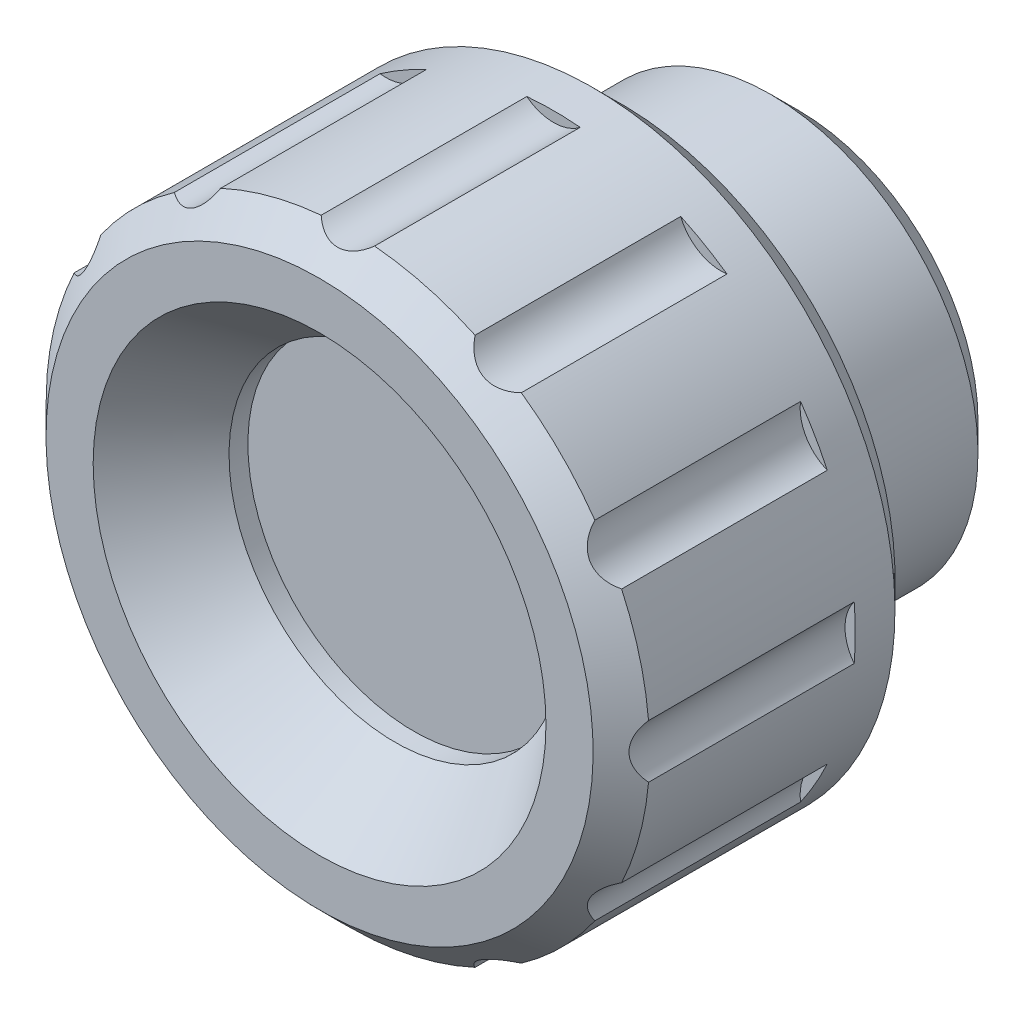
ISO-10303-21;
HEADER;
FILE_DESCRIPTION(('STEP AP214'),'2;1');
FILE_NAME('part.step','',(''),(''),'','','');
FILE_SCHEMA(('AUTOMOTIVE_DESIGN { 1 0 10303 214 1 1 1 1 }'));
ENDSEC;
DATA;
#1=APPLICATION_CONTEXT('core data for automotive mechanical design processes');
#2=APPLICATION_PROTOCOL_DEFINITION('international standard','automotive_design',2000,#1);
#3=PRODUCT_CONTEXT('',#1,'mechanical');
#4=PRODUCT('Part','Part','',(#3));
#5=PRODUCT_RELATED_PRODUCT_CATEGORY('part','',(#4));
#6=PRODUCT_DEFINITION_FORMATION('','',#4);
#7=PRODUCT_DEFINITION_CONTEXT('part definition',#1,'design');
#8=PRODUCT_DEFINITION('design','',#6,#7);
#9=PRODUCT_DEFINITION_SHAPE('','',#8);
#10=(LENGTH_UNIT() NAMED_UNIT(*) SI_UNIT(.MILLI.,.METRE.));
#11=(NAMED_UNIT(*) PLANE_ANGLE_UNIT() SI_UNIT($,.RADIAN.));
#12=(NAMED_UNIT(*) SI_UNIT($,.STERADIAN.) SOLID_ANGLE_UNIT());
#13=UNCERTAINTY_MEASURE_WITH_UNIT(LENGTH_MEASURE(1.E-05),#10,'distance_accuracy_value','');
#14=(GEOMETRIC_REPRESENTATION_CONTEXT(3) GLOBAL_UNCERTAINTY_ASSIGNED_CONTEXT((#13)) GLOBAL_UNIT_ASSIGNED_CONTEXT((#10,
#11,#12)) REPRESENTATION_CONTEXT('',''));
#15=CARTESIAN_POINT('',(0.,0.,0.));
#16=DIRECTION('',(0.,0.,1.));
#17=DIRECTION('',(1.,0.,0.));
#18=AXIS2_PLACEMENT_3D('',#15,#16,#17);
#19=CARTESIAN_POINT('',(3.49999999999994,0.,0.));
#20=DIRECTION('',(0.,0.,-1.));
#21=DIRECTION('',(0.,1.,0.));
#22=AXIS2_PLACEMENT_3D('',#19,#20,#21);
#23=PLANE('',#22);
#24=CARTESIAN_POINT('',(0.,0.,0.));
#25=DIRECTION('',(0.,0.,-1.));
#26=DIRECTION('',(-1.,0.,0.));
#27=AXIS2_PLACEMENT_3D('',#24,#25,#26);
#28=CIRCLE('',#27,2.95);
#29=CARTESIAN_POINT('',(-2.95,0.,0.));
#30=VERTEX_POINT('',#29);
#31=EDGE_CURVE('E9',#30,#30,#28,.F.);
#32=ORIENTED_EDGE('',*,*,#31,.T.);
#33=EDGE_LOOP('',(#32));
#34=FACE_BOUND('',#33,.T.);
#35=CARTESIAN_POINT('',(0.,0.,0.));
#36=DIRECTION('',(0.,0.,-1.));
#37=DIRECTION('',(0.,1.,0.));
#38=AXIS2_PLACEMENT_3D('',#35,#36,#37);
#39=CIRCLE('',#38,3.49999999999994);
#40=CARTESIAN_POINT('',(0.,3.49999999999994,0.));
#41=VERTEX_POINT('',#40);
#42=EDGE_CURVE('E354',#41,#41,#39,.T.);
#43=ORIENTED_EDGE('',*,*,#42,.T.);
#44=EDGE_LOOP('',(#43));
#45=FACE_BOUND('',#44,.T.);
#46=ADVANCED_FACE('F14',(#34,#45),#23,.T.);
#47=CARTESIAN_POINT('',(0.,0.,0.));
#48=DIRECTION('',(0.,0.,-1.));
#49=DIRECTION('',(0.,1.,0.));
#50=AXIS2_PLACEMENT_3D('',#47,#48,#49);
#51=CYLINDRICAL_SURFACE('',#50,3.49999999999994);
#52=CARTESIAN_POINT('',(0.,0.,0.300000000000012));
#53=DIRECTION('',(0.,0.,-1.));
#54=DIRECTION('',(0.,1.,0.));
#55=AXIS2_PLACEMENT_3D('',#52,#53,#54);
#56=CIRCLE('',#55,3.49999999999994);
#57=CARTESIAN_POINT('',(0.,3.49999999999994,0.300000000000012));
#58=VERTEX_POINT('',#57);
#59=EDGE_CURVE('E351',#58,#58,#56,.T.);
#60=ORIENTED_EDGE('',*,*,#59,.T.);
#61=EDGE_LOOP('',(#60));
#62=FACE_BOUND('',#61,.T.);
#63=ORIENTED_EDGE('',*,*,#42,.F.);
#64=EDGE_LOOP('',(#63));
#65=FACE_BOUND('',#64,.T.);
#66=ADVANCED_FACE('F406',(#62,#65),#51,.T.);
#67=CARTESIAN_POINT('',(4.74999999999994,0.,0.300000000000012));
#68=DIRECTION('',(0.,0.,-1.));
#69=DIRECTION('',(0.,1.,0.));
#70=AXIS2_PLACEMENT_3D('',#67,#68,#69);
#71=PLANE('',#70);
#72=CARTESIAN_POINT('',(0.,0.,0.300000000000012));
#73=DIRECTION('',(0.,0.,-1.));
#74=DIRECTION('',(0.,1.,0.));
#75=AXIS2_PLACEMENT_3D('',#72,#73,#74);
#76=CIRCLE('',#75,4.74999999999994);
#77=CARTESIAN_POINT('',(0.,4.74999999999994,0.300000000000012));
#78=VERTEX_POINT('',#77);
#79=EDGE_CURVE('E348',#78,#78,#76,.T.);
#80=ORIENTED_EDGE('',*,*,#79,.T.);
#81=EDGE_LOOP('',(#80));
#82=FACE_BOUND('',#81,.T.);
#83=ORIENTED_EDGE('',*,*,#59,.F.);
#84=EDGE_LOOP('',(#83));
#85=FACE_BOUND('',#84,.T.);
#86=ADVANCED_FACE('F413',(#82,#85),#71,.T.);
#87=CARTESIAN_POINT('',(0.,0.,0.300000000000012));
#88=DIRECTION('',(0.,0.,1.));
#89=DIRECTION('',(0.,-1.,0.));
#90=AXIS2_PLACEMENT_3D('',#87,#88,#89);
#91=CONICAL_SURFACE('',#90,4.74999999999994,0.785398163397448);
#92=CARTESIAN_POINT('',(0.,0.,1.05000000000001));
#93=DIRECTION('',(0.,0.,-1.));
#94=DIRECTION('',(0.,1.,0.));
#95=AXIS2_PLACEMENT_3D('',#92,#93,#94);
#96=CIRCLE('',#95,5.49999999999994);
#97=CARTESIAN_POINT('',(0.,5.49999999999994,1.05000000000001));
#98=VERTEX_POINT('',#97);
#99=EDGE_CURVE('E344',#98,#98,#96,.T.);
#100=ORIENTED_EDGE('',*,*,#99,.T.);
#101=EDGE_LOOP('',(#100));
#102=FACE_BOUND('',#101,.T.);
#103=ORIENTED_EDGE('',*,*,#79,.F.);
#104=EDGE_LOOP('',(#103));
#105=FACE_BOUND('',#104,.T.);
#106=ADVANCED_FACE('F864',(#102,#105),#91,.T.);
#107=CARTESIAN_POINT('',(0.,0.,0.));
#108=DIRECTION('',(0.,0.,-1.));
#109=DIRECTION('',(0.,1.,0.));
#110=AXIS2_PLACEMENT_3D('',#107,#108,#109);
#111=CYLINDRICAL_SURFACE('',#110,5.49999999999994);
#112=CARTESIAN_POINT('',(0.,0.,5.));
#113=DIRECTION('',(0.,0.,-1.));
#114=DIRECTION('',(-1.,0.,0.));
#115=AXIS2_PLACEMENT_3D('',#112,#113,#114);
#116=CIRCLE('',#115,5.49999999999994);
#117=CARTESIAN_POINT('',(-5.49999999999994,0.,5.));
#118=VERTEX_POINT('',#117);
#119=EDGE_CURVE('E211',#118,#118,#116,.F.);
#120=ORIENTED_EDGE('',*,*,#119,.F.);
#121=EDGE_LOOP('',(#120));
#122=FACE_BOUND('',#121,.T.);
#123=ORIENTED_EDGE('',*,*,#99,.F.);
#124=EDGE_LOOP('',(#123));
#125=FACE_BOUND('',#124,.T.);
#126=ADVANCED_FACE('F465',(#122,#125),#111,.T.);
#127=CARTESIAN_POINT('',(0.,8.,5.));
#128=DIRECTION('',(0.,0.,-1.));
#129=DIRECTION('',(-1.,0.,0.));
#130=AXIS2_PLACEMENT_3D('',#127,#128,#129);
#131=PLANE('',#130);
#132=CARTESIAN_POINT('',(0.,0.,5.));
#133=DIRECTION('',(0.,0.,-1.));
#134=DIRECTION('',(-1.,0.,0.));
#135=AXIS2_PLACEMENT_3D('',#132,#133,#134);
#136=CIRCLE('',#135,7.25);
#137=CARTESIAN_POINT('',(-7.25,0.,5.));
#138=VERTEX_POINT('',#137);
#139=EDGE_CURVE('E216',#138,#138,#136,.T.);
#140=ORIENTED_EDGE('',*,*,#139,.T.);
#141=EDGE_LOOP('',(#140));
#142=FACE_BOUND('',#141,.T.);
#143=ORIENTED_EDGE('',*,*,#119,.T.);
#144=EDGE_LOOP('',(#143));
#145=FACE_BOUND('',#144,.T.);
#146=ADVANCED_FACE('F420',(#142,#145),#131,.T.);
#147=CARTESIAN_POINT('',(4.4,0.,10.5000000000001));
#148=DIRECTION('',(0.,0.,1.));
#149=DIRECTION('',(0.,-1.,0.));
#150=AXIS2_PLACEMENT_3D('',#147,#148,#149);
#151=PLANE('',#150);
#152=CARTESIAN_POINT('',(0.,0.,10.5000000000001));
#153=DIRECTION('',(0.,0.,-1.));
#154=DIRECTION('',(0.,1.,0.));
#155=AXIS2_PLACEMENT_3D('',#152,#153,#154);
#156=CIRCLE('',#155,4.4);
#157=CARTESIAN_POINT('',(0.,4.4,10.5000000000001));
#158=VERTEX_POINT('',#157);
#159=EDGE_CURVE('E288',#158,#158,#156,.T.);
#160=ORIENTED_EDGE('',*,*,#159,.F.);
#161=EDGE_LOOP('',(#160));
#162=FACE_BOUND('',#161,.T.);
#163=ADVANCED_FACE('F394',(#162),#151,.T.);
#164=CARTESIAN_POINT('',(0.,0.,0.));
#165=DIRECTION('',(0.,0.,-1.));
#166=DIRECTION('',(0.,1.,0.));
#167=AXIS2_PLACEMENT_3D('',#164,#165,#166);
#168=CYLINDRICAL_SURFACE('',#167,4.4);
#169=ORIENTED_EDGE('',*,*,#159,.T.);
#170=EDGE_LOOP('',(#169));
#171=FACE_BOUND('',#170,.T.);
#172=CARTESIAN_POINT('',(0.,0.,11.));
#173=DIRECTION('',(0.,0.,-1.));
#174=DIRECTION('',(0.,1.,0.));
#175=AXIS2_PLACEMENT_3D('',#172,#173,#174);
#176=CIRCLE('',#175,4.4);
#177=CARTESIAN_POINT('',(0.,4.4,11.));
#178=VERTEX_POINT('',#177);
#179=EDGE_CURVE('E332',#178,#178,#176,.T.);
#180=ORIENTED_EDGE('',*,*,#179,.F.);
#181=EDGE_LOOP('',(#180));
#182=FACE_BOUND('',#181,.T.);
#183=ADVANCED_FACE('F390',(#171,#182),#168,.F.);
#184=CARTESIAN_POINT('',(0.,0.,13.));
#185=DIRECTION('',(0.,0.,1.));
#186=DIRECTION('',(0.,-1.,0.));
#187=AXIS2_PLACEMENT_3D('',#184,#185,#186);
#188=CONICAL_SURFACE('',#187,6.,0.67474094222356);
#189=ORIENTED_EDGE('',*,*,#179,.T.);
#190=EDGE_LOOP('',(#189));
#191=FACE_BOUND('',#190,.T.);
#192=CARTESIAN_POINT('',(0.,0.,13.));
#193=DIRECTION('',(0.,0.,-1.));
#194=DIRECTION('',(0.,1.,0.));
#195=AXIS2_PLACEMENT_3D('',#192,#193,#194);
#196=CIRCLE('',#195,6.);
#197=CARTESIAN_POINT('',(0.,6.,13.));
#198=VERTEX_POINT('',#197);
#199=EDGE_CURVE('E335',#198,#198,#196,.T.);
#200=ORIENTED_EDGE('',*,*,#199,.F.);
#201=EDGE_LOOP('',(#200));
#202=FACE_BOUND('',#201,.T.);
#203=ADVANCED_FACE('F393',(#191,#202),#188,.F.);
#204=CARTESIAN_POINT('',(6.,0.,13.));
#205=DIRECTION('',(0.,0.,1.));
#206=DIRECTION('',(0.,-1.,0.));
#207=AXIS2_PLACEMENT_3D('',#204,#205,#206);
#208=PLANE('',#207);
#209=ORIENTED_EDGE('',*,*,#199,.T.);
#210=EDGE_LOOP('',(#209));
#211=FACE_BOUND('',#210,.T.);
#212=CARTESIAN_POINT('',(0.,0.,13.));
#213=DIRECTION('',(0.,0.,-1.));
#214=DIRECTION('',(0.,1.,0.));
#215=AXIS2_PLACEMENT_3D('',#212,#213,#214);
#216=CIRCLE('',#215,7.25);
#217=CARTESIAN_POINT('',(0.,7.25,13.));
#218=VERTEX_POINT('',#217);
#219=EDGE_CURVE('E338',#218,#218,#216,.T.);
#220=ORIENTED_EDGE('',*,*,#219,.F.);
#221=EDGE_LOOP('',(#220));
#222=FACE_BOUND('',#221,.T.);
#223=ADVANCED_FACE('F386',(#211,#222),#208,.T.);
#224=CARTESIAN_POINT('',(0.,0.,6.8));
#225=DIRECTION('',(0.,0.,1.));
#226=DIRECTION('',(0.,-1.,0.));
#227=AXIS2_PLACEMENT_3D('',#224,#225,#226);
#228=PLANE('',#227);
#229=CARTESIAN_POINT('',(-1.2490009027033E-13,-8.87500000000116,6.8));
#230=DIRECTION('',(0.,0.,-1.));
#231=DIRECTION('',(0.,-1.,0.));
#232=AXIS2_PLACEMENT_3D('',#229,#230,#231);
#233=CIRCLE('',#232,1.15);
#234=CARTESIAN_POINT('',(-0.707804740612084,-7.96862676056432,6.8));
#235=VERTEX_POINT('',#234);
#236=CARTESIAN_POINT('',(0.70780474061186,-7.96862676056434,6.8));
#237=VERTEX_POINT('',#236);
#238=EDGE_CURVE('E275',#235,#237,#233,.T.);
#239=ORIENTED_EDGE('',*,*,#238,.F.);
#240=CARTESIAN_POINT('',(0.,0.,6.8));
#241=DIRECTION('',(0.,0.,1.));
#242=DIRECTION('',(0.,-1.,0.));
#243=AXIS2_PLACEMENT_3D('',#240,#241,#242);
#244=CIRCLE('',#243,8.);
#245=EDGE_CURVE('E222',#237,#235,#244,.F.);
#246=ORIENTED_EDGE('',*,*,#245,.F.);
#247=EDGE_LOOP('',(#239,#246));
#248=FACE_BOUND('',#247,.T.);
#249=ADVANCED_FACE('F382',(#248),#228,.T.);
#250=CARTESIAN_POINT('',(-1.2490009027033E-13,-8.87500000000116,6.8));
#251=DIRECTION('',(0.,0.,1.));
#252=DIRECTION('',(0.,-1.,0.));
#253=AXIS2_PLACEMENT_3D('',#250,#251,#252);
#254=CYLINDRICAL_SURFACE('',#253,1.15);
#255=DIRECTION('',(0.,0.,1.));
#256=VECTOR('',#255,1.);
#257=CARTESIAN_POINT('',(-0.707804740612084,-7.96862676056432,6.8));
#258=LINE('',#257,#256);
#259=CARTESIAN_POINT('',(-0.707804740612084,-7.96862676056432,12.2499999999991));
#260=VERTEX_POINT('',#259);
#261=EDGE_CURVE('E301',#235,#260,#258,.T.);
#262=ORIENTED_EDGE('',*,*,#261,.F.);
#263=ORIENTED_EDGE('',*,*,#238,.T.);
#264=DIRECTION('',(0.,0.,1.));
#265=VECTOR('',#264,1.);
#266=CARTESIAN_POINT('',(0.70780474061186,-7.96862676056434,6.8));
#267=LINE('',#266,#265);
#268=CARTESIAN_POINT('',(0.707804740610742,-7.96862676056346,12.25));
#269=VERTEX_POINT('',#268);
#270=EDGE_CURVE('E299',#237,#269,#267,.T.);
#271=ORIENTED_EDGE('',*,*,#270,.T.);
#272=CARTESIAN_POINT('',(-0.708004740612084,-7.96878298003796,12.2498266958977));
#273=CARTESIAN_POINT('',(-0.670016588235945,-7.93910304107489,12.2827435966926));
#274=CARTESIAN_POINT('',(-0.629096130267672,-7.91098728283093,12.3141461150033));
#275=CARTESIAN_POINT('',(-0.541113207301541,-7.85895957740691,12.3725489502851));
#276=CARTESIAN_POINT('',(-0.493993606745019,-7.83509230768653,12.3995022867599));
#277=CARTESIAN_POINT('',(-0.403110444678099,-7.79705455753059,12.4426329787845));
#278=CARTESIAN_POINT('',(-0.360275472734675,-7.7819114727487,12.4598771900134));
#279=CARTESIAN_POINT('',(-0.271519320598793,-7.75656520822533,12.4888070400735));
#280=CARTESIAN_POINT('',(-0.225610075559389,-7.74634405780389,12.5005128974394));
#281=CARTESIAN_POINT('',(-0.131281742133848,-7.73151414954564,12.5175147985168));
#282=CARTESIAN_POINT('',(-0.0828445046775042,-7.72695427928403,12.522755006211));
#283=CARTESIAN_POINT('',(0.014487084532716,-7.72406175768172,12.5260777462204));
#284=CARTESIAN_POINT('',(0.0633815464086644,-7.72573064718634,12.5241585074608));
#285=CARTESIAN_POINT('',(0.154026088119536,-7.73456075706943,12.5140225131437));
#286=CARTESIAN_POINT('',(0.195934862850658,-7.74104594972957,12.5065809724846));
#287=CARTESIAN_POINT('',(0.277692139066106,-7.7582480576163,12.4868901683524));
#288=CARTESIAN_POINT('',(0.31753961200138,-7.76896706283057,12.4746385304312));
#289=CARTESIAN_POINT('',(0.408286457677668,-7.79851491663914,12.440973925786));
#290=CARTESIAN_POINT('',(0.458050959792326,-7.8188729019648,12.4178517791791));
#291=CARTESIAN_POINT('',(0.551931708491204,-7.86474498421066,12.3660439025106));
#292=CARTESIAN_POINT('',(0.596041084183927,-7.89026525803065,12.3373515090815));
#293=CARTESIAN_POINT('',(0.661880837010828,-7.93410696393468,12.2883657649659));
#294=CARTESIAN_POINT('',(0.685443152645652,-7.95116148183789,12.2693731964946));
#295=CARTESIAN_POINT('',(0.708004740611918,-7.96878298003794,12.2498266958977));
#296=B_SPLINE_CURVE_WITH_KNOTS('',3,(#272,#273,#274,#275,#276,#277,#278,#279,#280,#281,#282,
#283,#284,#285,#286,#287,#288,#289,#290,#291,#292,#293,#294,#295),.UNSPECIFIED.,.F.,.F.,(4,2,2,
2,2,2,2,2,2,2,2,4),(0.,0.17542065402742,0.352589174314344,0.497789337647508,0.642455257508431,
0.78836193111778,0.934304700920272,1.06290984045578,1.19157854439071,1.36619586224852,
1.54102336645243,1.64509140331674),.UNSPECIFIED.);
#297=EDGE_CURVE('E493',#260,#269,#296,.T.);
#298=ORIENTED_EDGE('',*,*,#297,.F.);
#299=EDGE_LOOP('',(#262,#263,#271,#298));
#300=FACE_BOUND('',#299,.T.);
#301=ADVANCED_FACE('F385',(#300),#254,.F.);
#302=CARTESIAN_POINT('',(4.43750000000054,-7.68597545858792,6.8));
#303=DIRECTION('',(0.,0.,-1.));
#304=DIRECTION('',(0.,-1.,0.));
#305=AXIS2_PLACEMENT_3D('',#302,#303,#304);
#306=CIRCLE('',#305,1.15);
#307=CARTESIAN_POINT('',(3.37133649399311,-7.25493557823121,6.8));
#308=VERTEX_POINT('',#307);
#309=CARTESIAN_POINT('',(4.59729026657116,-6.54713083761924,6.8));
#310=VERTEX_POINT('',#309);
#311=EDGE_CURVE('E278',#308,#310,#306,.T.);
#312=ORIENTED_EDGE('',*,*,#311,.F.);
#313=EDGE_CURVE('E218',#310,#308,#244,.F.);
#314=ORIENTED_EDGE('',*,*,#313,.F.);
#315=EDGE_LOOP('',(#312,#314));
#316=FACE_BOUND('',#315,.T.);
#317=ADVANCED_FACE('F389',(#316),#228,.T.);
#318=CARTESIAN_POINT('',(4.43750000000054,-7.68597545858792,6.8));
#319=DIRECTION('',(0.,0.,1.));
#320=DIRECTION('',(0.,-1.,0.));
#321=AXIS2_PLACEMENT_3D('',#318,#319,#320);
#322=CYLINDRICAL_SURFACE('',#321,1.15);
#323=DIRECTION('',(0.,0.,1.));
#324=VECTOR('',#323,1.);
#325=CARTESIAN_POINT('',(3.37133649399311,-7.25493557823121,6.8));
#326=LINE('',#325,#324);
#327=CARTESIAN_POINT('',(3.37133649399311,-7.25493557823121,12.2499999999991));
#328=VERTEX_POINT('',#327);
#329=EDGE_CURVE('E297',#308,#328,#326,.T.);
#330=ORIENTED_EDGE('',*,*,#329,.F.);
#331=ORIENTED_EDGE('',*,*,#311,.T.);
#332=DIRECTION('',(0.,0.,1.));
#333=VECTOR('',#332,1.);
#334=CARTESIAN_POINT('',(4.59729026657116,-6.54713083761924,6.8));
#335=LINE('',#334,#333);
#336=CARTESIAN_POINT('',(4.59729026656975,-6.54713083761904,12.25));
#337=VERTEX_POINT('',#336);
#338=EDGE_CURVE('E295',#310,#337,#335,.T.);
#339=ORIENTED_EDGE('',*,*,#338,.T.);
#340=CARTESIAN_POINT('',(3.37125565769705,-7.25513557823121,12.2498526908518));
#341=CARTESIAN_POINT('',(3.38931533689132,-7.2104398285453,12.2827673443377));
#342=CARTESIAN_POINT('',(3.41069638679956,-7.16563264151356,12.3141675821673));
#343=CARTESIAN_POINT('',(3.46087905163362,-7.07658806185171,12.3725658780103));
#344=CARTESIAN_POINT('',(3.48975247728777,-7.032360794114,12.399516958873));
#345=CARTESIAN_POINT('',(3.54944136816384,-6.95398075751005,12.4426442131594));
#346=CARTESIAN_POINT('',(3.57896658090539,-6.91945000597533,12.459887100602));
#347=CARTESIAN_POINT('',(3.64315945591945,-6.85312362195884,12.4888142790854));
#348=CARTESIAN_POINT('',(3.67780779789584,-6.82131839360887,12.5005187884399));
#349=CARTESIAN_POINT('',(3.75208390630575,-6.76131362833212,12.5175180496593));
#350=CARTESIAN_POINT('',(3.79175182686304,-6.73314735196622,12.5227569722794));
#351=CARTESIAN_POINT('',(3.87459677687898,-6.68197914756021,12.5260773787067));
#352=CARTESIAN_POINT('',(3.91777467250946,-6.65897849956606,12.5241570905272));
#353=CARTESIAN_POINT('',(4.00068974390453,-6.62130533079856,12.5140193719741));
#354=CARTESIAN_POINT('',(4.04022639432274,-6.60596809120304,12.5065770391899));
#355=CARTESIAN_POINT('',(4.1196311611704,-6.57998847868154,12.4868847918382));
#356=CARTESIAN_POINT('',(4.15949943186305,-6.56934843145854,12.4746325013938));
#357=CARTESIAN_POINT('',(4.25286326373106,-6.54956561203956,12.4409660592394));
#358=CARTESIAN_POINT('',(4.30614049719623,-6.54231471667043,12.4178426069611));
#359=CARTESIAN_POINT('',(4.41038121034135,-6.53510255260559,12.3660321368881));
#360=CARTESIAN_POINT('',(4.46134183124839,-6.53515005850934,12.3373384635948));
#361=CARTESIAN_POINT('',(4.54025639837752,-6.54019818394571,12.2883669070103));
#362=CARTESIAN_POINT('',(4.56916440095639,-6.54318368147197,12.269391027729));
#363=CARTESIAN_POINT('',(4.59749026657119,-6.5471589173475,12.2498620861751));
#364=B_SPLINE_CURVE_WITH_KNOTS('',3,(#340,#341,#342,#343,#344,#345,#346,#347,#348,#349,#350,
#351,#352,#353,#354,#355,#356,#357,#358,#359,#360,#361,#362,#363),.UNSPECIFIED.,.F.,.F.,(4,2,2,
2,2,2,2,2,2,2,2,4),(0.,0.175413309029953,0.352574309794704,0.497771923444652,0.64243531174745,
0.788339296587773,0.934279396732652,1.06288407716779,1.19155236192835,1.36617341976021,
1.54100441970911,1.64498267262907),.UNSPECIFIED.);
#365=EDGE_CURVE('E486',#328,#337,#364,.T.);
#366=ORIENTED_EDGE('',*,*,#365,.F.);
#367=EDGE_LOOP('',(#330,#331,#339,#366));
#368=FACE_BOUND('',#367,.T.);
#369=ADVANCED_FACE('F500',(#368),#322,.F.);
#370=CARTESIAN_POINT('',(7.68597545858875,-4.43749999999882,6.8));
#371=DIRECTION('',(0.,0.,-1.));
#372=DIRECTION('',(0.,-1.,0.));
#373=AXIS2_PLACEMENT_3D('',#370,#371,#372);
#374=CIRCLE('',#373,1.15000000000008);
#375=CARTESIAN_POINT('',(6.54713083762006,-4.59729026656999,6.8));
#376=VERTEX_POINT('',#375);
#377=CARTESIAN_POINT('',(7.25493557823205,-3.37133649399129,6.8));
#378=VERTEX_POINT('',#377);
#379=EDGE_CURVE('E281',#376,#378,#374,.T.);
#380=ORIENTED_EDGE('',*,*,#379,.F.);
#381=EDGE_CURVE('E212',#378,#376,#244,.F.);
#382=ORIENTED_EDGE('',*,*,#381,.F.);
#383=EDGE_LOOP('',(#380,#382));
#384=FACE_BOUND('',#383,.T.);
#385=ADVANCED_FACE('F503',(#384),#228,.T.);
#386=CARTESIAN_POINT('',(7.68597545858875,-4.43749999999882,6.8));
#387=DIRECTION('',(0.,0.,1.));
#388=DIRECTION('',(0.,-1.,0.));
#389=AXIS2_PLACEMENT_3D('',#386,#387,#388);
#390=CYLINDRICAL_SURFACE('',#389,1.15000000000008);
#391=DIRECTION('',(0.,0.,1.));
#392=VECTOR('',#391,1.);
#393=CARTESIAN_POINT('',(6.54713083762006,-4.59729026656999,6.8));
#394=LINE('',#393,#392);
#395=CARTESIAN_POINT('',(6.54713083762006,-4.59729026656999,12.2499999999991));
#396=VERTEX_POINT('',#395);
#397=EDGE_CURVE('E293',#376,#396,#394,.T.);
#398=ORIENTED_EDGE('',*,*,#397,.F.);
#399=ORIENTED_EDGE('',*,*,#379,.T.);
#400=DIRECTION('',(0.,0.,1.));
#401=VECTOR('',#400,1.);
#402=CARTESIAN_POINT('',(7.25493557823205,-3.37133649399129,6.8));
#403=LINE('',#402,#401);
#404=CARTESIAN_POINT('',(7.25493557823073,-3.37133649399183,12.25));
#405=VERTEX_POINT('',#404);
#406=EDGE_CURVE('E291',#378,#405,#403,.T.);
#407=ORIENTED_EDGE('',*,*,#406,.T.);
#408=CARTESIAN_POINT('',(6.54715891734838,-4.59749026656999,12.249862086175));
#409=CARTESIAN_POINT('',(6.54045182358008,-4.54975319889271,12.2827759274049));
#410=CARTESIAN_POINT('',(6.53656536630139,-4.50025899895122,12.3141753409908));
#411=CARTESIAN_POINT('',(6.53550363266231,-4.39805391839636,12.3725719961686));
#412=CARTESIAN_POINT('',(6.53839560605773,-4.34531590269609,12.3995222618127));
#413=CARTESIAN_POINT('',(6.55089846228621,-4.24759324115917,12.4426482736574));
#414=CARTESIAN_POINT('',(6.55920303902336,-4.20292634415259,12.4598906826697));
#415=CARTESIAN_POINT('',(6.58163319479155,-4.11339009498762,12.4888168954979));
#416=CARTESIAN_POINT('',(6.59573724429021,-4.06852209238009,12.5005209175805));
#417=CARTESIAN_POINT('',(6.63006040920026,-3.97941910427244,12.5175192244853));
#418=CARTESIAN_POINT('',(6.65033092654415,-3.93519284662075,12.5227576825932));
#419=CARTESIAN_POINT('',(6.69649299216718,-3.84945829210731,12.5260772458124));
#420=CARTESIAN_POINT('',(6.72238593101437,-3.8079506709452,12.5241565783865));
#421=CARTESIAN_POINT('',(6.77535612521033,-3.73386792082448,12.5140182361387));
#422=CARTESIAN_POINT('',(6.80192739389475,-3.70081740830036,12.5065756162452));
#423=CARTESIAN_POINT('',(6.85770436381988,-3.63861654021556,12.486882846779));
#424=CARTESIAN_POINT('',(6.88691136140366,-3.60946812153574,12.4746303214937));
#425=CARTESIAN_POINT('',(6.95787590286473,-3.54565408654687,12.4409632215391));
#426=CARTESIAN_POINT('',(7.00039031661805,-3.51273611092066,12.4178393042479));
#427=CARTESIAN_POINT('',(7.08706015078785,-3.45437012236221,12.3660279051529));
#428=CARTESIAN_POINT('',(7.13121748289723,-3.42893113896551,12.3373337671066));
#429=CARTESIAN_POINT('',(7.20208570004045,-3.39384524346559,12.2883604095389));
#430=CARTESIAN_POINT('',(7.22861528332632,-3.38197627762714,12.2693831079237));
#431=CARTESIAN_POINT('',(7.25513557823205,-3.37125565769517,12.2498526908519));
#432=B_SPLINE_CURVE_WITH_KNOTS('',3,(#408,#409,#410,#411,#412,#413,#414,#415,#416,#417,#418,
#419,#420,#421,#422,#423,#424,#425,#426,#427,#428,#429,#430,#431),.UNSPECIFIED.,.F.,.F.,(4,2,2,
2,2,2,2,2,2,2,2,4),(0.,0.175410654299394,0.352568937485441,0.497765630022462,0.642428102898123,
0.788331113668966,0.934270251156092,1.06287477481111,1.19154289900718,1.36616525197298,
1.54099757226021,1.64498268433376),.UNSPECIFIED.);
#433=EDGE_CURVE('E207',#396,#405,#432,.T.);
#434=ORIENTED_EDGE('',*,*,#433,.F.);
#435=EDGE_LOOP('',(#398,#399,#407,#434));
#436=FACE_BOUND('',#435,.T.);
#437=ADVANCED_FACE('F472',(#436),#390,.F.);
#438=CARTESIAN_POINT('',(8.87500000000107,1.83793952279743E-12,6.8));
#439=DIRECTION('',(0.,0.,-1.));
#440=DIRECTION('',(0.,-1.,0.));
#441=AXIS2_PLACEMENT_3D('',#438,#439,#440);
#442=CIRCLE('',#441,1.15);
#443=CARTESIAN_POINT('',(7.96862676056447,-0.707804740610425,6.8));
#444=VERTEX_POINT('',#443);
#445=CARTESIAN_POINT('',(7.96862676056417,0.707804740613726,6.8));
#446=VERTEX_POINT('',#445);
#447=EDGE_CURVE('E189',#444,#446,#442,.T.);
#448=ORIENTED_EDGE('',*,*,#447,.F.);
#449=EDGE_CURVE('E203',#446,#444,#244,.F.);
#450=ORIENTED_EDGE('',*,*,#449,.F.);
#451=EDGE_LOOP('',(#448,#450));
#452=FACE_BOUND('',#451,.T.);
#453=ADVANCED_FACE('F470',(#452),#228,.T.);
#454=CARTESIAN_POINT('',(8.87500000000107,1.83793952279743E-12,6.8));
#455=DIRECTION('',(0.,0.,1.));
#456=DIRECTION('',(0.,-1.,0.));
#457=AXIS2_PLACEMENT_3D('',#454,#455,#456);
#458=CYLINDRICAL_SURFACE('',#457,1.15);
#459=DIRECTION('',(0.,0.,1.));
#460=VECTOR('',#459,1.);
#461=CARTESIAN_POINT('',(7.96862676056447,-0.707804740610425,6.8));
#462=LINE('',#461,#460);
#463=CARTESIAN_POINT('',(7.96862676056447,-0.707804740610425,12.2499999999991));
#464=VERTEX_POINT('',#463);
#465=EDGE_CURVE('E289',#444,#464,#462,.T.);
#466=ORIENTED_EDGE('',*,*,#465,.F.);
#467=ORIENTED_EDGE('',*,*,#447,.T.);
#468=DIRECTION('',(0.,0.,1.));
#469=VECTOR('',#468,1.);
#470=CARTESIAN_POINT('',(7.96862676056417,0.707804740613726,6.8));
#471=LINE('',#470,#469);
#472=CARTESIAN_POINT('',(7.9686267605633,0.707804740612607,12.25));
#473=VERTEX_POINT('',#472);
#474=EDGE_CURVE('E286',#446,#473,#471,.T.);
#475=ORIENTED_EDGE('',*,*,#474,.T.);
#476=CARTESIAN_POINT('',(7.9687829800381,-0.708004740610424,12.2498266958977));
#477=CARTESIAN_POINT('',(7.93910304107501,-0.670016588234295,12.2827435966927));
#478=CARTESIAN_POINT('',(7.91098728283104,-0.629096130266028,12.3141461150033));
#479=CARTESIAN_POINT('',(7.85895957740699,-0.541113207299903,12.3725489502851));
#480=CARTESIAN_POINT('',(7.83509230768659,-0.49399360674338,12.3995022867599));
#481=CARTESIAN_POINT('',(7.79705455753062,-0.403110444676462,12.4426329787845));
#482=CARTESIAN_POINT('',(7.78191147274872,-0.36027547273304,12.4598771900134));
#483=CARTESIAN_POINT('',(7.75656520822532,-0.271519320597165,12.4888070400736));
#484=CARTESIAN_POINT('',(7.74634405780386,-0.225610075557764,12.5005128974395));
#485=CARTESIAN_POINT('',(7.73151414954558,-0.131281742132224,12.5175147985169));
#486=CARTESIAN_POINT('',(7.72695427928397,-0.0828445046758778,12.5227550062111));
#487=CARTESIAN_POINT('',(7.72406175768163,0.0144870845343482,12.5260777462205));
#488=CARTESIAN_POINT('',(7.72573064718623,0.0633815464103,12.5241585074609));
#489=CARTESIAN_POINT('',(7.7345607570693,0.154026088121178,12.5140225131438));
#490=CARTESIAN_POINT('',(7.74104594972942,0.195934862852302,12.5065809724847));
#491=CARTESIAN_POINT('',(7.75824805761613,0.277692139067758,12.4868901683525));
#492=CARTESIAN_POINT('',(7.76896706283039,0.317539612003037,12.4746385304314));
#493=CARTESIAN_POINT('',(7.79851491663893,0.408286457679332,12.4409739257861));
#494=CARTESIAN_POINT('',(7.81887290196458,0.458050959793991,12.4178517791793));
#495=CARTESIAN_POINT('',(7.86474498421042,0.551931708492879,12.3660439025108));
#496=CARTESIAN_POINT('',(7.89026525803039,0.596041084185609,12.3373515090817));
#497=CARTESIAN_POINT('',(7.93410696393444,0.661880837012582,12.288365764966));
#498=CARTESIAN_POINT('',(7.95116148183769,0.685443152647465,12.2693731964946));
#499=CARTESIAN_POINT('',(7.96878298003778,0.708004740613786,12.2498266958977));
#500=B_SPLINE_CURVE_WITH_KNOTS('',3,(#476,#477,#478,#479,#480,#481,#482,#483,#484,#485,#486,
#487,#488,#489,#490,#491,#492,#493,#494,#495,#496,#497,#498,#499),.UNSPECIFIED.,.F.,.F.,(4,2,2,
2,2,2,2,2,2,2,2,4),(0.,0.175420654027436,0.352589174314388,0.497789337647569,0.642455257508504,
0.788361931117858,0.934304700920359,1.06290984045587,1.19157854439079,1.36619586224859,
1.5410233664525,1.64509140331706),.UNSPECIFIED.);
#501=EDGE_CURVE('E201',#464,#473,#500,.T.);
#502=ORIENTED_EDGE('',*,*,#501,.F.);
#503=EDGE_LOOP('',(#466,#467,#475,#502));
#504=FACE_BOUND('',#503,.T.);
#505=ADVANCED_FACE('F466',(#504),#458,.F.);
#506=CARTESIAN_POINT('',(7.68597545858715,4.43750000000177,6.8));
#507=DIRECTION('',(0.,0.,-1.));
#508=DIRECTION('',(0.,-1.,0.));
#509=AXIS2_PLACEMENT_3D('',#506,#507,#508);
#510=CIRCLE('',#509,1.15);
#511=CARTESIAN_POINT('',(7.25493557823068,3.37133649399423,6.8));
#512=VERTEX_POINT('',#511);
#513=CARTESIAN_POINT('',(6.54713083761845,4.59729026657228,6.8));
#514=VERTEX_POINT('',#513);
#515=EDGE_CURVE('E180',#512,#514,#510,.T.);
#516=ORIENTED_EDGE('',*,*,#515,.F.);
#517=EDGE_CURVE('E193',#514,#512,#244,.F.);
#518=ORIENTED_EDGE('',*,*,#517,.F.);
#519=EDGE_LOOP('',(#516,#518));
#520=FACE_BOUND('',#519,.T.);
#521=ADVANCED_FACE('F192',(#520),#228,.T.);
#522=CARTESIAN_POINT('',(7.68597545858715,4.43750000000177,6.8));
#523=DIRECTION('',(0.,0.,1.));
#524=DIRECTION('',(0.,-1.,0.));
#525=AXIS2_PLACEMENT_3D('',#522,#523,#524);
#526=CYLINDRICAL_SURFACE('',#525,1.15);
#527=DIRECTION('',(0.,0.,1.));
#528=VECTOR('',#527,1.);
#529=CARTESIAN_POINT('',(7.25493557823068,3.37133649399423,6.8));
#530=LINE('',#529,#528);
#531=CARTESIAN_POINT('',(7.25493557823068,3.37133649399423,12.2499999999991));
#532=VERTEX_POINT('',#531);
#533=EDGE_CURVE('E177',#512,#532,#530,.T.);
#534=ORIENTED_EDGE('',*,*,#533,.F.);
#535=ORIENTED_EDGE('',*,*,#515,.T.);
#536=DIRECTION('',(0.,0.,1.));
#537=VECTOR('',#536,1.);
#538=CARTESIAN_POINT('',(6.54713083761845,4.59729026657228,6.8));
#539=LINE('',#538,#537);
#540=CARTESIAN_POINT('',(6.54713083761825,4.59729026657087,12.25));
#541=VERTEX_POINT('',#540);
#542=EDGE_CURVE('E188',#514,#541,#539,.T.);
#543=ORIENTED_EDGE('',*,*,#542,.T.);
#544=CARTESIAN_POINT('',(7.25513557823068,3.37125565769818,12.2498526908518));
#545=CARTESIAN_POINT('',(7.21043982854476,3.38931533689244,12.2827673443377));
#546=CARTESIAN_POINT('',(7.16563264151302,3.41069638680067,12.3141675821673));
#547=CARTESIAN_POINT('',(7.07658806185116,3.46087905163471,12.3725658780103));
#548=CARTESIAN_POINT('',(7.03236079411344,3.48975247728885,12.399516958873));
#549=CARTESIAN_POINT('',(6.95398075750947,3.5494413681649,12.4426442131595));
#550=CARTESIAN_POINT('',(6.91945000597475,3.57896658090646,12.459887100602));
#551=CARTESIAN_POINT('',(6.85312362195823,3.6431594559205,12.4888142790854));
#552=CARTESIAN_POINT('',(6.82131839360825,3.67780779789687,12.50051878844));
#553=CARTESIAN_POINT('',(6.76131362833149,3.75208390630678,12.5175180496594));
#554=CARTESIAN_POINT('',(6.73314735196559,3.79175182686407,12.5227569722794));
#555=CARTESIAN_POINT('',(6.68197914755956,3.87459677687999,12.5260773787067));
#556=CARTESIAN_POINT('',(6.6589784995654,3.91777467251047,12.5241570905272));
#557=CARTESIAN_POINT('',(6.62130533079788,4.00068974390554,12.5140193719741));
#558=CARTESIAN_POINT('',(6.60596809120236,4.04022639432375,12.50657703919));
#559=CARTESIAN_POINT('',(6.57998847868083,4.1196311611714,12.4868847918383));
#560=CARTESIAN_POINT('',(6.56934843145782,4.15949943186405,12.4746325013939));
#561=CARTESIAN_POINT('',(6.54956561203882,4.25286326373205,12.4409660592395));
#562=CARTESIAN_POINT('',(6.54231471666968,4.30614049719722,12.4178426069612));
#563=CARTESIAN_POINT('',(6.53510255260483,4.41038121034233,12.3660321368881));
#564=CARTESIAN_POINT('',(6.53515005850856,4.46134183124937,12.3373384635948));
#565=CARTESIAN_POINT('',(6.54019818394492,4.54025639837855,12.2883669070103));
#566=CARTESIAN_POINT('',(6.54318368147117,4.56916440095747,12.269391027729));
#567=CARTESIAN_POINT('',(6.54715891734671,4.59749026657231,12.2498620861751));
#568=B_SPLINE_CURVE_WITH_KNOTS('',3,(#544,#545,#546,#547,#548,#549,#550,#551,#552,#553,#554,
#555,#556,#557,#558,#559,#560,#561,#562,#563,#564,#565,#566,#567),.UNSPECIFIED.,.F.,.F.,(4,2,2,
2,2,2,2,2,2,2,2,4),(0.,0.175413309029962,0.352574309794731,0.497771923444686,0.642435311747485,
0.788339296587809,0.934279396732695,1.06288407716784,1.1915523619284,1.36617341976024,
1.54100441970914,1.64498267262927),.UNSPECIFIED.);
#569=EDGE_CURVE('E183',#532,#541,#568,.T.);
#570=ORIENTED_EDGE('',*,*,#569,.F.);
#571=EDGE_LOOP('',(#534,#535,#543,#570));
#572=FACE_BOUND('',#571,.T.);
#573=ADVANCED_FACE('F179',(#572),#526,.F.);
#574=CARTESIAN_POINT('',(4.43750000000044,7.68597545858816,6.8));
#575=DIRECTION('',(0.,0.,-1.));
#576=DIRECTION('',(0.,-1.,0.));
#577=AXIS2_PLACEMENT_3D('',#574,#575,#576);
#578=CIRCLE('',#577,1.15);
#579=CARTESIAN_POINT('',(4.59729026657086,6.54713083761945,6.8));
#580=VERTEX_POINT('',#579);
#581=CARTESIAN_POINT('',(3.3713364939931,7.25493557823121,6.8));
#582=VERTEX_POINT('',#581);
#583=EDGE_CURVE('E194',#580,#582,#578,.T.);
#584=ORIENTED_EDGE('',*,*,#583,.F.);
#585=EDGE_CURVE('E200',#582,#580,#244,.F.);
#586=ORIENTED_EDGE('',*,*,#585,.F.);
#587=EDGE_LOOP('',(#584,#586));
#588=FACE_BOUND('',#587,.T.);
#589=ADVANCED_FACE('F378',(#588),#228,.T.);
#590=CARTESIAN_POINT('',(4.43750000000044,7.68597545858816,6.8));
#591=DIRECTION('',(0.,0.,1.));
#592=DIRECTION('',(0.,-1.,0.));
#593=AXIS2_PLACEMENT_3D('',#590,#591,#592);
#594=CYLINDRICAL_SURFACE('',#593,1.15);
#595=DIRECTION('',(0.,0.,1.));
#596=VECTOR('',#595,1.);
#597=CARTESIAN_POINT('',(4.59729026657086,6.54713083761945,6.8));
#598=LINE('',#597,#596);
#599=CARTESIAN_POINT('',(4.59729026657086,6.54713083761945,12.2499999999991));
#600=VERTEX_POINT('',#599);
#601=EDGE_CURVE('E326',#580,#600,#598,.T.);
#602=ORIENTED_EDGE('',*,*,#601,.F.);
#603=ORIENTED_EDGE('',*,*,#583,.T.);
#604=DIRECTION('',(0.,0.,1.));
#605=VECTOR('',#604,1.);
#606=CARTESIAN_POINT('',(3.3713364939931,7.25493557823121,6.8));
#607=LINE('',#606,#605);
#608=CARTESIAN_POINT('',(3.37133649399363,7.25493557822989,12.25));
#609=VERTEX_POINT('',#608);
#610=EDGE_CURVE('E324',#582,#609,#607,.T.);
#611=ORIENTED_EDGE('',*,*,#610,.T.);
#612=CARTESIAN_POINT('',(4.59749026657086,6.54715891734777,12.249862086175));
#613=CARTESIAN_POINT('',(4.5497531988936,6.5404518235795,12.2827759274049));
#614=CARTESIAN_POINT('',(4.50025899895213,6.53656536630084,12.3141753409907));
#615=CARTESIAN_POINT('',(4.39805391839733,6.53550363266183,12.3725719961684));
#616=CARTESIAN_POINT('',(4.34531590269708,6.53839560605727,12.3995222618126));
#617=CARTESIAN_POINT('',(4.2475932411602,6.5508984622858,12.4426482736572));
#618=CARTESIAN_POINT('',(4.20292634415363,6.55920303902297,12.4598906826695));
#619=CARTESIAN_POINT('',(4.11339009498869,6.5816331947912,12.4888168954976));
#620=CARTESIAN_POINT('',(4.06852209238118,6.59573724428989,12.5005209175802));
#621=CARTESIAN_POINT('',(3.97941910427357,6.63006040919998,12.517519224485));
#622=CARTESIAN_POINT('',(3.9351928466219,6.65033092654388,12.5227576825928));
#623=CARTESIAN_POINT('',(3.84945829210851,6.69649299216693,12.526077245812));
#624=CARTESIAN_POINT('',(3.80795067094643,6.72238593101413,12.5241565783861));
#625=CARTESIAN_POINT('',(3.73386792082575,6.77535612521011,12.5140182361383));
#626=CARTESIAN_POINT('',(3.70081740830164,6.80192739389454,12.5065756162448));
#627=CARTESIAN_POINT('',(3.63861654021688,6.85770436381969,12.4868828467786));
#628=CARTESIAN_POINT('',(3.60946812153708,6.88691136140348,12.4746303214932));
#629=CARTESIAN_POINT('',(3.54565408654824,6.95787590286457,12.4409632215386));
#630=CARTESIAN_POINT('',(3.51273611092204,7.00039031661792,12.4178393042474));
#631=CARTESIAN_POINT('',(3.45437012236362,7.08706015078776,12.3660279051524));
#632=CARTESIAN_POINT('',(3.42893113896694,7.13121748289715,12.3373337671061));
#633=CARTESIAN_POINT('',(3.39384524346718,7.20208570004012,12.2883604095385));
#634=CARTESIAN_POINT('',(3.38197627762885,7.22861528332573,12.2693831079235));
#635=CARTESIAN_POINT('',(3.37125565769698,7.25513557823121,12.2498526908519));
#636=B_SPLINE_CURVE_WITH_KNOTS('',3,(#612,#613,#614,#615,#616,#617,#618,#619,#620,#621,#622,
#623,#624,#625,#626,#627,#628,#629,#630,#631,#632,#633,#634,#635),.UNSPECIFIED.,.F.,.F.,(4,2,2,
2,2,2,2,2,2,2,2,4),(0.,0.175410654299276,0.35256893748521,0.497765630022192,0.642428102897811,
0.788331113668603,0.934270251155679,1.06287477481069,1.19154289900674,1.36616525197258,
1.54099757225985,1.64498268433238),.UNSPECIFIED.);
#637=EDGE_CURVE('E364',#600,#609,#636,.T.);
#638=ORIENTED_EDGE('',*,*,#637,.F.);
#639=EDGE_LOOP('',(#602,#603,#611,#638));
#640=FACE_BOUND('',#639,.T.);
#641=ADVANCED_FACE('F379',(#640),#594,.F.);
#642=CARTESIAN_POINT('',(9.3198018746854E-13,8.8750000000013,6.8));
#643=DIRECTION('',(0.,0.,-1.));
#644=DIRECTION('',(0.,-1.,0.));
#645=AXIS2_PLACEMENT_3D('',#642,#643,#644);
#646=CIRCLE('',#645,1.15);
#647=CARTESIAN_POINT('',(0.707804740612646,7.96862676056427,6.8));
#648=VERTEX_POINT('',#647);
#649=CARTESIAN_POINT('',(-0.707804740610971,7.96862676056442,6.8));
#650=VERTEX_POINT('',#649);
#651=EDGE_CURVE('E255',#648,#650,#646,.T.);
#652=ORIENTED_EDGE('',*,*,#651,.F.);
#653=EDGE_CURVE('E205',#650,#648,#244,.F.);
#654=ORIENTED_EDGE('',*,*,#653,.F.);
#655=EDGE_LOOP('',(#652,#654));
#656=FACE_BOUND('',#655,.T.);
#657=ADVANCED_FACE('F254',(#656),#228,.T.);
#658=CARTESIAN_POINT('',(9.3198018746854E-13,8.8750000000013,6.8));
#659=DIRECTION('',(0.,0.,1.));
#660=DIRECTION('',(0.,-1.,0.));
#661=AXIS2_PLACEMENT_3D('',#658,#659,#660);
#662=CYLINDRICAL_SURFACE('',#661,1.15);
#663=DIRECTION('',(0.,0.,1.));
#664=VECTOR('',#663,1.);
#665=CARTESIAN_POINT('',(0.707804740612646,7.96862676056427,6.8));
#666=LINE('',#665,#664);
#667=CARTESIAN_POINT('',(0.707804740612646,7.96862676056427,12.2499999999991));
#668=VERTEX_POINT('',#667);
#669=EDGE_CURVE('E249',#648,#668,#666,.T.);
#670=ORIENTED_EDGE('',*,*,#669,.F.);
#671=ORIENTED_EDGE('',*,*,#651,.T.);
#672=DIRECTION('',(0.,0.,1.));
#673=VECTOR('',#672,1.);
#674=CARTESIAN_POINT('',(-0.707804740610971,7.96862676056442,6.8));
#675=LINE('',#674,#673);
#676=CARTESIAN_POINT('',(-0.707804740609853,7.96862676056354,12.25));
#677=VERTEX_POINT('',#676);
#678=EDGE_CURVE('E29',#650,#677,#675,.T.);
#679=ORIENTED_EDGE('',*,*,#678,.T.);
#680=CARTESIAN_POINT('',(0.708004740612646,7.96878298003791,12.2498266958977));
#681=CARTESIAN_POINT('',(0.670016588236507,7.93910304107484,12.2827435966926));
#682=CARTESIAN_POINT('',(0.629096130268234,7.9109872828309,12.3141461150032));
#683=CARTESIAN_POINT('',(0.541113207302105,7.85895957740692,12.372548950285));
#684=CARTESIAN_POINT('',(0.493993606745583,7.83509230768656,12.3995022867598));
#685=CARTESIAN_POINT('',(0.403110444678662,7.79705455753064,12.4426329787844));
#686=CARTESIAN_POINT('',(0.360275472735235,7.78191147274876,12.4598771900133));
#687=CARTESIAN_POINT('',(0.271519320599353,7.7565652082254,12.4888070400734));
#688=CARTESIAN_POINT('',(0.225610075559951,7.74634405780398,12.5005128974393));
#689=CARTESIAN_POINT('',(0.131281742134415,7.73151414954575,12.5175147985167));
#690=CARTESIAN_POINT('',(0.0828445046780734,7.72695427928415,12.5227550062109));
#691=CARTESIAN_POINT('',(-0.0144870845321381,7.72406175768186,12.5260777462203));
#692=CARTESIAN_POINT('',(-0.0633815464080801,7.7257306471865,12.5241585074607));
#693=CARTESIAN_POINT('',(-0.154026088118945,7.73456075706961,12.5140225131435));
#694=CARTESIAN_POINT('',(-0.195934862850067,7.74104594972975,12.5065809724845));
#695=CARTESIAN_POINT('',(-0.277692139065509,7.75824805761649,12.4868901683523));
#696=CARTESIAN_POINT('',(-0.317539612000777,7.76896706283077,12.4746385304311));
#697=CARTESIAN_POINT('',(-0.40828645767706,7.79851491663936,12.4409739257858));
#698=CARTESIAN_POINT('',(-0.458050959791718,7.81887290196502,12.4178517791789));
#699=CARTESIAN_POINT('',(-0.551931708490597,7.86474498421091,12.3660439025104));
#700=CARTESIAN_POINT('',(-0.596041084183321,7.89026525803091,12.3373515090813));
#701=CARTESIAN_POINT('',(-0.66188083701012,7.93410696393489,12.2883657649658));
#702=CARTESIAN_POINT('',(-0.685443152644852,7.95116148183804,12.2693731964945));
#703=CARTESIAN_POINT('',(-0.708004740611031,7.96878298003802,12.2498266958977));
#704=B_SPLINE_CURVE_WITH_KNOTS('',3,(#680,#681,#682,#683,#684,#685,#686,#687,#688,#689,#690,
#691,#692,#693,#694,#695,#696,#697,#698,#699,#700,#701,#702,#703),.UNSPECIFIED.,.F.,.F.,(4,2,2,
2,2,2,2,2,2,2,2,4),(0.,0.175420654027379,0.352589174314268,0.497789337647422,0.642455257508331,
0.788361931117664,0.934304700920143,1.06290984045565,1.19157854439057,1.3661958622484,
1.54102336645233,1.64509140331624),.UNSPECIFIED.);
#705=EDGE_CURVE('E566',#668,#677,#704,.T.);
#706=ORIENTED_EDGE('',*,*,#705,.F.);
#707=EDGE_LOOP('',(#670,#671,#679,#706));
#708=FACE_BOUND('',#707,.T.);
#709=ADVANCED_FACE('F256',(#708),#662,.F.);
#710=CARTESIAN_POINT('',(-4.43749999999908,7.6859754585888,6.8));
#711=DIRECTION('',(0.,0.,-1.));
#712=DIRECTION('',(0.,-1.,0.));
#713=AXIS2_PLACEMENT_3D('',#710,#711,#712);
#714=CIRCLE('',#713,1.14999999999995);
#715=CARTESIAN_POINT('',(-3.37133649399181,7.25493557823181,6.8));
#716=VERTEX_POINT('',#715);
#717=CARTESIAN_POINT('',(-4.5972902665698,6.54713083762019,6.8));
#718=VERTEX_POINT('',#717);
#719=EDGE_CURVE('E257',#716,#718,#714,.T.);
#720=ORIENTED_EDGE('',*,*,#719,.F.);
#721=EDGE_CURVE('E241',#718,#716,#244,.F.);
#722=ORIENTED_EDGE('',*,*,#721,.F.);
#723=EDGE_LOOP('',(#720,#722));
#724=FACE_BOUND('',#723,.T.);
#725=ADVANCED_FACE('F559',(#724),#228,.T.);
#726=CARTESIAN_POINT('',(-4.43749999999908,7.6859754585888,6.8));
#727=DIRECTION('',(0.,0.,1.));
#728=DIRECTION('',(0.,-1.,0.));
#729=AXIS2_PLACEMENT_3D('',#726,#727,#728);
#730=CYLINDRICAL_SURFACE('',#729,1.14999999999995);
#731=DIRECTION('',(0.,0.,1.));
#732=VECTOR('',#731,1.);
#733=CARTESIAN_POINT('',(-3.37133649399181,7.25493557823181,6.8));
#734=LINE('',#733,#732);
#735=CARTESIAN_POINT('',(-3.37133649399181,7.25493557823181,12.2499999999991));
#736=VERTEX_POINT('',#735);
#737=EDGE_CURVE('E320',#716,#736,#734,.T.);
#738=ORIENTED_EDGE('',*,*,#737,.F.);
#739=ORIENTED_EDGE('',*,*,#719,.T.);
#740=DIRECTION('',(0.,0.,1.));
#741=VECTOR('',#740,1.);
#742=CARTESIAN_POINT('',(-4.5972902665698,6.54713083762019,6.8));
#743=LINE('',#742,#741);
#744=CARTESIAN_POINT('',(-4.5972902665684,6.54713083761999,12.25));
#745=VERTEX_POINT('',#744);
#746=EDGE_CURVE('E37',#718,#745,#743,.T.);
#747=ORIENTED_EDGE('',*,*,#746,.T.);
#748=CARTESIAN_POINT('',(-3.37125565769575,7.25513557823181,12.2498526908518));
#749=CARTESIAN_POINT('',(-3.38931533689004,7.21043982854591,12.2827673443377));
#750=CARTESIAN_POINT('',(-3.41069638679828,7.16563264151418,12.3141675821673));
#751=CARTESIAN_POINT('',(-3.46087905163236,7.07658806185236,12.3725658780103));
#752=CARTESIAN_POINT('',(-3.48975247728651,7.03236079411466,12.3995169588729));
#753=CARTESIAN_POINT('',(-3.54944136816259,6.95398075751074,12.4426442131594));
#754=CARTESIAN_POINT('',(-3.57896658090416,6.91945000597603,12.4598871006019));
#755=CARTESIAN_POINT('',(-3.64315945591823,6.85312362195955,12.4888142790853));
#756=CARTESIAN_POINT('',(-3.67780779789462,6.8213183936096,12.5005187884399));
#757=CARTESIAN_POINT('',(-3.75208390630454,6.76131362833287,12.5175180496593));
#758=CARTESIAN_POINT('',(-3.79175182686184,6.73314735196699,12.5227569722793));
#759=CARTESIAN_POINT('',(-3.87459677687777,6.68197914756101,12.5260773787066));
#760=CARTESIAN_POINT('',(-3.91777467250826,6.65897849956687,12.5241570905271));
#761=CARTESIAN_POINT('',(-4.00068974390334,6.62130533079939,12.514019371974));
#762=CARTESIAN_POINT('',(-4.04022639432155,6.60596809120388,12.5065770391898));
#763=CARTESIAN_POINT('',(-4.11963116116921,6.57998847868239,12.4868847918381));
#764=CARTESIAN_POINT('',(-4.15949943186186,6.5693484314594,12.4746325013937));
#765=CARTESIAN_POINT('',(-4.25286326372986,6.54956561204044,12.4409660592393));
#766=CARTESIAN_POINT('',(-4.30614049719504,6.54231471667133,12.417842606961));
#767=CARTESIAN_POINT('',(-4.41038121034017,6.53510255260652,12.3660321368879));
#768=CARTESIAN_POINT('',(-4.4613418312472,6.53515005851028,12.3373384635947));
#769=CARTESIAN_POINT('',(-4.54025639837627,6.54019818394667,12.2883669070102));
#770=CARTESIAN_POINT('',(-4.56916440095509,6.54318368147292,12.269391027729));
#771=CARTESIAN_POINT('',(-4.59749026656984,6.54715891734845,12.2498620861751));
#772=B_SPLINE_CURVE_WITH_KNOTS('',3,(#748,#749,#750,#751,#752,#753,#754,#755,#756,#757,#758,
#759,#760,#761,#762,#763,#764,#765,#766,#767,#768,#769,#770,#771),.UNSPECIFIED.,.F.,.F.,(4,2,2,
2,2,2,2,2,2,2,2,4),(0.,0.175413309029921,0.352574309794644,0.497771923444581,0.642435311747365,
0.788339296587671,0.934279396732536,1.06288407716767,1.19155236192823,1.36617341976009,
1.54100441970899,1.64498267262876),.UNSPECIFIED.);
#773=EDGE_CURVE('E561',#736,#745,#772,.T.);
#774=ORIENTED_EDGE('',*,*,#773,.F.);
#775=EDGE_LOOP('',(#738,#739,#747,#774));
#776=FACE_BOUND('',#775,.T.);
#777=ADVANCED_FACE('F556',(#776),#730,.F.);
#778=CARTESIAN_POINT('',(-7.68597545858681,4.4375000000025,6.8));
#779=DIRECTION('',(0.,0.,-1.));
#780=DIRECTION('',(0.,-1.,0.));
#781=AXIS2_PLACEMENT_3D('',#778,#779,#780);
#782=CIRCLE('',#781,1.15);
#783=CARTESIAN_POINT('',(-6.54713083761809,4.59729026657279,6.8));
#784=VERTEX_POINT('',#783);
#785=CARTESIAN_POINT('',(-7.25493557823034,3.37133649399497,6.8));
#786=VERTEX_POINT('',#785);
#787=EDGE_CURVE('E259',#784,#786,#782,.T.);
#788=ORIENTED_EDGE('',*,*,#787,.F.);
#789=EDGE_CURVE('E237',#786,#784,#244,.F.);
#790=ORIENTED_EDGE('',*,*,#789,.F.);
#791=EDGE_LOOP('',(#788,#790));
#792=FACE_BOUND('',#791,.T.);
#793=ADVANCED_FACE('F554',(#792),#228,.T.);
#794=CARTESIAN_POINT('',(-7.68597545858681,4.4375000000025,6.8));
#795=DIRECTION('',(0.,0.,1.));
#796=DIRECTION('',(0.,-1.,0.));
#797=AXIS2_PLACEMENT_3D('',#794,#795,#796);
#798=CYLINDRICAL_SURFACE('',#797,1.15);
#799=DIRECTION('',(0.,0.,1.));
#800=VECTOR('',#799,1.);
#801=CARTESIAN_POINT('',(-6.54713083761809,4.59729026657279,6.8));
#802=LINE('',#801,#800);
#803=CARTESIAN_POINT('',(-6.54713083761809,4.59729026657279,12.2499999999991));
#804=VERTEX_POINT('',#803);
#805=EDGE_CURVE('E317',#784,#804,#802,.T.);
#806=ORIENTED_EDGE('',*,*,#805,.F.);
#807=ORIENTED_EDGE('',*,*,#787,.T.);
#808=DIRECTION('',(0.,0.,1.));
#809=VECTOR('',#808,1.);
#810=CARTESIAN_POINT('',(-7.25493557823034,3.37133649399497,6.8));
#811=LINE('',#810,#809);
#812=CARTESIAN_POINT('',(-7.25493557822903,3.3713364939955,12.25));
#813=VERTEX_POINT('',#812);
#814=EDGE_CURVE('E315',#786,#813,#811,.T.);
#815=ORIENTED_EDGE('',*,*,#814,.T.);
#816=CARTESIAN_POINT('',(-6.54715891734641,4.59749026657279,12.249862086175));
#817=CARTESIAN_POINT('',(-6.54045182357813,4.54975319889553,12.2827759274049));
#818=CARTESIAN_POINT('',(-6.53656536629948,4.50025899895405,12.3141753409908));
#819=CARTESIAN_POINT('',(-6.53550363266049,4.39805391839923,12.3725719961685));
#820=CARTESIAN_POINT('',(-6.53839560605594,4.34531590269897,12.3995222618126));
#821=CARTESIAN_POINT('',(-6.55089846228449,4.24759324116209,12.4426482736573));
#822=CARTESIAN_POINT('',(-6.55920303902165,4.20292634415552,12.4598906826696));
#823=CARTESIAN_POINT('',(-6.5816331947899,4.11339009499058,12.4888168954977));
#824=CARTESIAN_POINT('',(-6.5957372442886,4.06852209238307,12.5005209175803));
#825=CARTESIAN_POINT('',(-6.6300604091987,3.97941910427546,12.5175192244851));
#826=CARTESIAN_POINT('',(-6.65033092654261,3.93519284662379,12.522757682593));
#827=CARTESIAN_POINT('',(-6.69649299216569,3.84945829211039,12.5260772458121));
#828=CARTESIAN_POINT('',(-6.7223859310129,3.80795067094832,12.5241565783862));
#829=CARTESIAN_POINT('',(-6.7753561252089,3.73386792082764,12.5140182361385));
#830=CARTESIAN_POINT('',(-6.80192739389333,3.70081740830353,12.506575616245));
#831=CARTESIAN_POINT('',(-6.85770436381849,3.63861654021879,12.4868828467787));
#832=CARTESIAN_POINT('',(-6.88691136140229,3.60946812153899,12.4746303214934));
#833=CARTESIAN_POINT('',(-6.95787590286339,3.54565408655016,12.4409632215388));
#834=CARTESIAN_POINT('',(-7.00039031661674,3.51273611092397,12.4178393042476));
#835=CARTESIAN_POINT('',(-7.08706015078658,3.45437012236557,12.3660279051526));
#836=CARTESIAN_POINT('',(-7.13121748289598,3.4289311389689,12.3373337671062));
#837=CARTESIAN_POINT('',(-7.20208570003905,3.39384524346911,12.2883604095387));
#838=CARTESIAN_POINT('',(-7.22861528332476,3.38197627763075,12.2693831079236));
#839=CARTESIAN_POINT('',(-7.25513557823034,3.37125565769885,12.2498526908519));
#840=B_SPLINE_CURVE_WITH_KNOTS('',3,(#816,#817,#818,#819,#820,#821,#822,#823,#824,#825,#826,
#827,#828,#829,#830,#831,#832,#833,#834,#835,#836,#837,#838,#839),.UNSPECIFIED.,.F.,.F.,(4,2,2,
2,2,2,2,2,2,2,2,4),(0.,0.17541065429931,0.352568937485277,0.497765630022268,0.642428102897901,
0.788331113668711,0.934270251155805,1.06287477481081,1.19154289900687,1.36616525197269,
1.54099757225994,1.64498268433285),.UNSPECIFIED.);
#841=EDGE_CURVE('E537',#804,#813,#840,.T.);
#842=ORIENTED_EDGE('',*,*,#841,.F.);
#843=EDGE_LOOP('',(#806,#807,#815,#842));
#844=FACE_BOUND('',#843,.T.);
#845=ADVANCED_FACE('F550',(#844),#798,.F.);
#846=CARTESIAN_POINT('',(-8.8750000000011,2.03049382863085E-12,6.8));
#847=DIRECTION('',(0.,0.,-1.));
#848=DIRECTION('',(0.,-1.,0.));
#849=AXIS2_PLACEMENT_3D('',#846,#847,#848);
#850=CIRCLE('',#849,1.15);
#851=CARTESIAN_POINT('',(-7.96862676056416,0.707804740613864,6.8));
#852=VERTEX_POINT('',#851);
#853=CARTESIAN_POINT('',(-7.96862676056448,-0.707804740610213,6.8));
#854=VERTEX_POINT('',#853);
#855=EDGE_CURVE('E266',#852,#854,#850,.T.);
#856=ORIENTED_EDGE('',*,*,#855,.F.);
#857=EDGE_CURVE('E233',#854,#852,#244,.F.);
#858=ORIENTED_EDGE('',*,*,#857,.F.);
#859=EDGE_LOOP('',(#856,#858));
#860=FACE_BOUND('',#859,.T.);
#861=ADVANCED_FACE('F548',(#860),#228,.T.);
#862=CARTESIAN_POINT('',(-8.8750000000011,2.03049382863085E-12,6.8));
#863=DIRECTION('',(0.,0.,1.));
#864=DIRECTION('',(0.,-1.,0.));
#865=AXIS2_PLACEMENT_3D('',#862,#863,#864);
#866=CYLINDRICAL_SURFACE('',#865,1.15);
#867=DIRECTION('',(0.,0.,1.));
#868=VECTOR('',#867,1.);
#869=CARTESIAN_POINT('',(-7.96862676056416,0.707804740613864,6.8));
#870=LINE('',#869,#868);
#871=CARTESIAN_POINT('',(-7.96862676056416,0.707804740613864,12.2499999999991));
#872=VERTEX_POINT('',#871);
#873=EDGE_CURVE('E313',#852,#872,#870,.T.);
#874=ORIENTED_EDGE('',*,*,#873,.F.);
#875=ORIENTED_EDGE('',*,*,#855,.T.);
#876=DIRECTION('',(0.,0.,1.));
#877=VECTOR('',#876,1.);
#878=CARTESIAN_POINT('',(-7.96862676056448,-0.707804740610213,6.8));
#879=LINE('',#878,#877);
#880=CARTESIAN_POINT('',(-7.96862676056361,-0.707804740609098,12.25));
#881=VERTEX_POINT('',#880);
#882=EDGE_CURVE('E311',#854,#881,#879,.T.);
#883=ORIENTED_EDGE('',*,*,#882,.T.);
#884=CARTESIAN_POINT('',(-7.9687829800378,0.708004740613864,12.2498266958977));
#885=CARTESIAN_POINT('',(-7.93910304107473,0.670016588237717,12.2827435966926));
#886=CARTESIAN_POINT('',(-7.91098728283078,0.629096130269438,12.3141461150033));
#887=CARTESIAN_POINT('',(-7.85895957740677,0.541113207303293,12.3725489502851));
#888=CARTESIAN_POINT('',(-7.83509230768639,0.493993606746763,12.3995022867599));
#889=CARTESIAN_POINT('',(-7.79705455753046,0.403110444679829,12.4426329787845));
#890=CARTESIAN_POINT('',(-7.78191147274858,0.360275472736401,12.4598771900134));
#891=CARTESIAN_POINT('',(-7.75656520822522,0.271519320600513,12.4888070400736));
#892=CARTESIAN_POINT('',(-7.74634405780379,0.225610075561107,12.5005128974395));
#893=CARTESIAN_POINT('',(-7.73151414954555,0.131281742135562,12.5175147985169));
#894=CARTESIAN_POINT('',(-7.72695427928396,0.0828445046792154,12.5227550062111));
#895=CARTESIAN_POINT('',(-7.72406175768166,-0.0144870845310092,12.5260777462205));
#896=CARTESIAN_POINT('',(-7.72573064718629,-0.0633815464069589,12.5241585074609));
#897=CARTESIAN_POINT('',(-7.7345607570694,-0.154026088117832,12.5140225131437));
#898=CARTESIAN_POINT('',(-7.74104594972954,-0.195934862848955,12.5065809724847));
#899=CARTESIAN_POINT('',(-7.75824805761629,-0.277692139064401,12.4868901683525));
#900=CARTESIAN_POINT('',(-7.76896706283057,-0.317539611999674,12.4746385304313));
#901=CARTESIAN_POINT('',(-7.79851491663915,-0.408286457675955,12.4409739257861));
#902=CARTESIAN_POINT('',(-7.81887290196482,-0.458050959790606,12.4178517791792));
#903=CARTESIAN_POINT('',(-7.8647449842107,-0.551931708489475,12.3660439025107));
#904=CARTESIAN_POINT('',(-7.89026525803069,-0.596041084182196,12.3373515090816));
#905=CARTESIAN_POINT('',(-7.93410696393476,-0.661880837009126,12.288365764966));
#906=CARTESIAN_POINT('',(-7.951161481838,-0.685443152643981,12.2693731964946));
#907=CARTESIAN_POINT('',(-7.96878298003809,-0.708004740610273,12.2498266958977));
#908=B_SPLINE_CURVE_WITH_KNOTS('',3,(#884,#885,#886,#887,#888,#889,#890,#891,#892,#893,#894,
#895,#896,#897,#898,#899,#900,#901,#902,#903,#904,#905,#906,#907),.UNSPECIFIED.,.F.,.F.,(4,2,2,
2,2,2,2,2,2,2,2,4),(0.,0.175420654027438,0.352589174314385,0.497789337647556,0.642455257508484,
0.788361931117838,0.934304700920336,1.06290984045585,1.19157854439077,1.36619586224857,
1.54102336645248,1.64509140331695),.UNSPECIFIED.);
#909=EDGE_CURVE('E530',#872,#881,#908,.T.);
#910=ORIENTED_EDGE('',*,*,#909,.F.);
#911=EDGE_LOOP('',(#874,#875,#883,#910));
#912=FACE_BOUND('',#911,.T.);
#913=ADVANCED_FACE('F544',(#912),#866,.F.);
#914=CARTESIAN_POINT('',(-7.68597545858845,-4.43749999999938,6.8));
#915=DIRECTION('',(0.,0.,-1.));
#916=DIRECTION('',(0.,-1.,0.));
#917=AXIS2_PLACEMENT_3D('',#914,#915,#916);
#918=CIRCLE('',#917,1.15);
#919=CARTESIAN_POINT('',(-7.25493557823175,-3.37133649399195,6.8));
#920=VERTEX_POINT('',#919);
#921=CARTESIAN_POINT('',(-6.54713083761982,-4.59729026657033,6.8));
#922=VERTEX_POINT('',#921);
#923=EDGE_CURVE('E269',#920,#922,#918,.T.);
#924=ORIENTED_EDGE('',*,*,#923,.F.);
#925=EDGE_CURVE('E230',#922,#920,#244,.F.);
#926=ORIENTED_EDGE('',*,*,#925,.F.);
#927=EDGE_LOOP('',(#924,#926));
#928=FACE_BOUND('',#927,.T.);
#929=ADVANCED_FACE('F547',(#928),#228,.T.);
#930=CARTESIAN_POINT('',(-7.68597545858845,-4.43749999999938,6.8));
#931=DIRECTION('',(0.,0.,1.));
#932=DIRECTION('',(0.,-1.,0.));
#933=AXIS2_PLACEMENT_3D('',#930,#931,#932);
#934=CYLINDRICAL_SURFACE('',#933,1.15);
#935=DIRECTION('',(0.,0.,1.));
#936=VECTOR('',#935,1.);
#937=CARTESIAN_POINT('',(-7.25493557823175,-3.37133649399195,6.8));
#938=LINE('',#937,#936);
#939=CARTESIAN_POINT('',(-7.25493557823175,-3.37133649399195,12.2499999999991));
#940=VERTEX_POINT('',#939);
#941=EDGE_CURVE('E309',#920,#940,#938,.T.);
#942=ORIENTED_EDGE('',*,*,#941,.F.);
#943=ORIENTED_EDGE('',*,*,#923,.T.);
#944=DIRECTION('',(0.,0.,1.));
#945=VECTOR('',#944,1.);
#946=CARTESIAN_POINT('',(-6.54713083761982,-4.59729026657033,6.8));
#947=LINE('',#946,#945);
#948=CARTESIAN_POINT('',(-6.54713083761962,-4.59729026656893,12.25));
#949=VERTEX_POINT('',#948);
#950=EDGE_CURVE('E307',#922,#949,#947,.T.);
#951=ORIENTED_EDGE('',*,*,#950,.T.);
#952=CARTESIAN_POINT('',(-7.25513557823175,-3.37125565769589,12.2498526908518));
#953=CARTESIAN_POINT('',(-7.21043982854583,-3.38931533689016,12.2827673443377));
#954=CARTESIAN_POINT('',(-7.16563264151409,-3.4106963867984,12.3141675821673));
#955=CARTESIAN_POINT('',(-7.07658806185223,-3.46087905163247,12.3725658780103));
#956=CARTESIAN_POINT('',(-7.03236079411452,-3.48975247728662,12.399516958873));
#957=CARTESIAN_POINT('',(-6.95398075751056,-3.5494413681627,12.4426442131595));
#958=CARTESIAN_POINT('',(-6.91945000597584,-3.57896658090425,12.4598871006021));
#959=CARTESIAN_POINT('',(-6.85312362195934,-3.64315945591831,12.4888142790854));
#960=CARTESIAN_POINT('',(-6.82131839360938,-3.6778077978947,12.50051878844));
#961=CARTESIAN_POINT('',(-6.76131362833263,-3.75208390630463,12.5175180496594));
#962=CARTESIAN_POINT('',(-6.73314735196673,-3.79175182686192,12.5227569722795));
#963=CARTESIAN_POINT('',(-6.68197914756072,-3.87459677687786,12.5260773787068));
#964=CARTESIAN_POINT('',(-6.65897849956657,-3.91777467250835,12.5241570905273));
#965=CARTESIAN_POINT('',(-6.62130533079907,-4.00068974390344,12.5140193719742));
#966=CARTESIAN_POINT('',(-6.60596809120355,-4.04022639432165,12.5065770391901));
#967=CARTESIAN_POINT('',(-6.57998847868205,-4.11963116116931,12.4868847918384));
#968=CARTESIAN_POINT('',(-6.56934843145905,-4.15949943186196,12.474632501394));
#969=CARTESIAN_POINT('',(-6.54956561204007,-4.25286326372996,12.4409660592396));
#970=CARTESIAN_POINT('',(-6.54231471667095,-4.30614049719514,12.4178426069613));
#971=CARTESIAN_POINT('',(-6.53510255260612,-4.41038121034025,12.3660321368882));
#972=CARTESIAN_POINT('',(-6.53515005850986,-4.46134183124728,12.3373384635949));
#973=CARTESIAN_POINT('',(-6.54019818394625,-4.5402563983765,12.2883669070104));
#974=CARTESIAN_POINT('',(-6.54318368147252,-4.56916440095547,12.2693910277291));
#975=CARTESIAN_POINT('',(-6.54715891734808,-4.59749026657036,12.2498620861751));
#976=B_SPLINE_CURVE_WITH_KNOTS('',3,(#952,#953,#954,#955,#956,#957,#958,#959,#960,#961,#962,
#963,#964,#965,#966,#967,#968,#969,#970,#971,#972,#973,#974,#975),.UNSPECIFIED.,.F.,.F.,(4,2,2,
2,2,2,2,2,2,2,2,4),(0.,0.175413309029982,0.352574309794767,0.497771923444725,0.642435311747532,
0.788339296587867,0.934279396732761,1.0628840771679,1.19155236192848,1.36617341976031,
1.54100441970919,1.64498267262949),.UNSPECIFIED.);
#977=EDGE_CURVE('E523',#940,#949,#976,.T.);
#978=ORIENTED_EDGE('',*,*,#977,.F.);
#979=EDGE_LOOP('',(#942,#943,#951,#978));
#980=FACE_BOUND('',#979,.T.);
#981=ADVANCED_FACE('F513',(#980),#934,.F.);
#982=CARTESIAN_POINT('',(0.,0.,12.25));
#983=DIRECTION('',(0.,0.,-1.));
#984=DIRECTION('',(0.,1.,0.));
#985=AXIS2_PLACEMENT_3D('',#982,#983,#984);
#986=CONICAL_SURFACE('',#985,8.,0.785398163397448);
#987=ORIENTED_EDGE('',*,*,#219,.T.);
#988=EDGE_LOOP('',(#987));
#989=FACE_BOUND('',#988,.T.);
#990=CARTESIAN_POINT('',(0.,0.,12.25));
#991=DIRECTION('',(0.,0.,-1.));
#992=DIRECTION('',(0.,1.,0.));
#993=AXIS2_PLACEMENT_3D('',#990,#991,#992);
#994=CIRCLE('',#993,8.);
#995=EDGE_CURVE('E647',#464,#405,#994,.T.);
#996=ORIENTED_EDGE('',*,*,#995,.F.);
#997=ORIENTED_EDGE('',*,*,#501,.T.);
#998=EDGE_CURVE('E650',#532,#473,#994,.T.);
#999=ORIENTED_EDGE('',*,*,#998,.F.);
#1000=ORIENTED_EDGE('',*,*,#569,.T.);
#1001=EDGE_CURVE('E345',#600,#541,#994,.T.);
#1002=ORIENTED_EDGE('',*,*,#1001,.F.);
#1003=ORIENTED_EDGE('',*,*,#637,.T.);
#1004=EDGE_CURVE('E342',#668,#609,#994,.T.);
#1005=ORIENTED_EDGE('',*,*,#1004,.F.);
#1006=ORIENTED_EDGE('',*,*,#705,.T.);
#1007=EDGE_CURVE('E341',#736,#677,#994,.T.);
#1008=ORIENTED_EDGE('',*,*,#1007,.F.);
#1009=ORIENTED_EDGE('',*,*,#773,.T.);
#1010=EDGE_CURVE('E640',#804,#745,#994,.T.);
#1011=ORIENTED_EDGE('',*,*,#1010,.F.);
#1012=ORIENTED_EDGE('',*,*,#841,.T.);
#1013=EDGE_CURVE('E637',#872,#813,#994,.T.);
#1014=ORIENTED_EDGE('',*,*,#1013,.F.);
#1015=ORIENTED_EDGE('',*,*,#909,.T.);
#1016=EDGE_CURVE('E634',#940,#881,#994,.T.);
#1017=ORIENTED_EDGE('',*,*,#1016,.F.);
#1018=ORIENTED_EDGE('',*,*,#977,.T.);
#1019=CARTESIAN_POINT('',(-4.59729026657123,-6.54713083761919,12.2499999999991));
#1020=VERTEX_POINT('',#1019);
#1021=EDGE_CURVE('E630',#1020,#949,#994,.T.);
#1022=ORIENTED_EDGE('',*,*,#1021,.F.);
#1023=CARTESIAN_POINT('',(-4.59749026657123,-6.5471589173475,12.249862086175));
#1024=CARTESIAN_POINT('',(-4.54975319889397,-6.54045182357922,12.2827759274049));
#1025=CARTESIAN_POINT('',(-4.50025899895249,-6.53656536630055,12.3141753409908));
#1026=CARTESIAN_POINT('',(-4.39805391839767,-6.53550363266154,12.3725719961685));
#1027=CARTESIAN_POINT('',(-4.34531590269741,-6.53839560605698,12.3995222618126));
#1028=CARTESIAN_POINT('',(-4.24759324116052,-6.5508984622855,12.4426482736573));
#1029=CARTESIAN_POINT('',(-4.20292634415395,-6.55920303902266,12.4598906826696));
#1030=CARTESIAN_POINT('',(-4.113390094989,-6.58163319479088,12.4888168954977));
#1031=CARTESIAN_POINT('',(-4.06852209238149,-6.59573724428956,12.5005209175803));
#1032=CARTESIAN_POINT('',(-3.97941910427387,-6.63006040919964,12.5175192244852));
#1033=CARTESIAN_POINT('',(-3.93519284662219,-6.65033092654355,12.522757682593));
#1034=CARTESIAN_POINT('',(-3.84945829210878,-6.6964929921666,12.5260772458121));
#1035=CARTESIAN_POINT('',(-3.8079506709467,-6.7223859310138,12.5241565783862));
#1036=CARTESIAN_POINT('',(-3.73386792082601,-6.77535612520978,12.5140182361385));
#1037=CARTESIAN_POINT('',(-3.7008174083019,-6.80192739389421,12.506575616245));
#1038=CARTESIAN_POINT('',(-3.63861654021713,-6.85770436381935,12.4868828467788));
#1039=CARTESIAN_POINT('',(-3.60946812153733,-6.88691136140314,12.4746303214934));
#1040=CARTESIAN_POINT('',(-3.54565408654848,-6.95787590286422,12.4409632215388));
#1041=CARTESIAN_POINT('',(-3.51273611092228,-7.00039031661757,12.4178393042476));
#1042=CARTESIAN_POINT('',(-3.45437012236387,-7.0870601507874,12.3660279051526));
#1043=CARTESIAN_POINT('',(-3.42893113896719,-7.13121748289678,12.3373337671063));
#1044=CARTESIAN_POINT('',(-3.39384524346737,-7.20208570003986,12.2883604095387));
#1045=CARTESIAN_POINT('',(-3.38197627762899,-7.22861528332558,12.2693831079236));
#1046=CARTESIAN_POINT('',(-3.37125565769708,-7.25513557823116,12.2498526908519));
#1047=B_SPLINE_CURVE_WITH_KNOTS('',3,(#1023,#1024,#1025,#1026,#1027,#1028,#1029,#1030,#1031,
#1032,#1033,#1034,#1035,#1036,#1037,#1038,#1039,#1040,#1041,#1042,#1043,#1044,#1045,#1046),
.UNSPECIFIED.,.F.,.F.,(4,2,2,2,2,2,2,2,2,2,2,4),(0.,0.175410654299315,0.352568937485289,
0.497765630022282,0.642428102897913,0.788331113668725,0.934270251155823,1.06287477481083,
1.19154289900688,1.36616525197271,1.54099757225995,1.64498268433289),.UNSPECIFIED.);
#1048=CARTESIAN_POINT('',(-3.37133649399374,-7.25493557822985,12.25));
#1049=VERTEX_POINT('',#1048);
#1050=EDGE_CURVE('E516',#1020,#1049,#1047,.T.);
#1051=ORIENTED_EDGE('',*,*,#1050,.T.);
#1052=EDGE_CURVE('E627',#260,#1049,#994,.T.);
#1053=ORIENTED_EDGE('',*,*,#1052,.F.);
#1054=ORIENTED_EDGE('',*,*,#297,.T.);
#1055=EDGE_CURVE('E629',#328,#269,#994,.T.);
#1056=ORIENTED_EDGE('',*,*,#1055,.F.);
#1057=ORIENTED_EDGE('',*,*,#365,.T.);
#1058=EDGE_CURVE('E632',#396,#337,#994,.T.);
#1059=ORIENTED_EDGE('',*,*,#1058,.F.);
#1060=ORIENTED_EDGE('',*,*,#433,.T.);
#1061=EDGE_LOOP('',(#996,#997,#999,#1000,#1002,#1003,#1005,#1006,#1008,#1009,#1011,#1012,#1014,
#1015,#1017,#1018,#1022,#1051,#1053,#1054,#1056,#1057,#1059,#1060));
#1062=FACE_BOUND('',#1061,.T.);
#1063=ADVANCED_FACE('F371',(#989,#1062),#986,.T.);
#1064=CARTESIAN_POINT('',(-4.43750000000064,-7.68597545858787,6.8));
#1065=DIRECTION('',(0.,0.,-1.));
#1066=DIRECTION('',(0.,-1.,0.));
#1067=AXIS2_PLACEMENT_3D('',#1064,#1065,#1066);
#1068=CIRCLE('',#1067,1.15);
#1069=CARTESIAN_POINT('',(-4.59729026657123,-6.54713083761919,6.8));
#1070=VERTEX_POINT('',#1069);
#1071=CARTESIAN_POINT('',(-3.37133649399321,-7.25493557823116,6.8));
#1072=VERTEX_POINT('',#1071);
#1073=EDGE_CURVE('E272',#1070,#1072,#1068,.T.);
#1074=ORIENTED_EDGE('',*,*,#1073,.F.);
#1075=EDGE_CURVE('E226',#1072,#1070,#244,.F.);
#1076=ORIENTED_EDGE('',*,*,#1075,.F.);
#1077=EDGE_LOOP('',(#1074,#1076));
#1078=FACE_BOUND('',#1077,.T.);
#1079=ADVANCED_FACE('F388',(#1078),#228,.T.);
#1080=CARTESIAN_POINT('',(-4.43750000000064,-7.68597545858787,6.8));
#1081=DIRECTION('',(0.,0.,1.));
#1082=DIRECTION('',(0.,-1.,0.));
#1083=AXIS2_PLACEMENT_3D('',#1080,#1081,#1082);
#1084=CYLINDRICAL_SURFACE('',#1083,1.15);
#1085=DIRECTION('',(0.,0.,1.));
#1086=VECTOR('',#1085,1.);
#1087=CARTESIAN_POINT('',(-4.59729026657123,-6.54713083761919,6.8));
#1088=LINE('',#1087,#1086);
#1089=EDGE_CURVE('E305',#1070,#1020,#1088,.T.);
#1090=ORIENTED_EDGE('',*,*,#1089,.F.);
#1091=ORIENTED_EDGE('',*,*,#1073,.T.);
#1092=DIRECTION('',(0.,0.,1.));
#1093=VECTOR('',#1092,1.);
#1094=CARTESIAN_POINT('',(-3.37133649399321,-7.25493557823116,6.8));
#1095=LINE('',#1094,#1093);
#1096=EDGE_CURVE('E303',#1072,#1049,#1095,.T.);
#1097=ORIENTED_EDGE('',*,*,#1096,.T.);
#1098=ORIENTED_EDGE('',*,*,#1050,.F.);
#1099=EDGE_LOOP('',(#1090,#1091,#1097,#1098));
#1100=FACE_BOUND('',#1099,.T.);
#1101=ADVANCED_FACE('F434',(#1100),#1084,.F.);
#1102=CARTESIAN_POINT('',(0.,0.,0.));
#1103=DIRECTION('',(0.,0.,-1.));
#1104=DIRECTION('',(0.,1.,0.));
#1105=AXIS2_PLACEMENT_3D('',#1102,#1103,#1104);
#1106=CYLINDRICAL_SURFACE('',#1105,8.);
#1107=CARTESIAN_POINT('',(0.,0.,5.75));
#1108=DIRECTION('',(0.,0.,-1.));
#1109=DIRECTION('',(-1.,0.,0.));
#1110=AXIS2_PLACEMENT_3D('',#1107,#1108,#1109);
#1111=CIRCLE('',#1110,8.);
#1112=CARTESIAN_POINT('',(-8.,0.,5.75));
#1113=VERTEX_POINT('',#1112);
#1114=EDGE_CURVE('E439',#1113,#1113,#1111,.F.);
#1115=ORIENTED_EDGE('',*,*,#1114,.T.);
#1116=EDGE_LOOP('',(#1115));
#1117=FACE_BOUND('',#1116,.T.);
#1118=ORIENTED_EDGE('',*,*,#1096,.F.);
#1119=ORIENTED_EDGE('',*,*,#1075,.T.);
#1120=ORIENTED_EDGE('',*,*,#1089,.T.);
#1121=ORIENTED_EDGE('',*,*,#1021,.T.);
#1122=ORIENTED_EDGE('',*,*,#950,.F.);
#1123=ORIENTED_EDGE('',*,*,#925,.T.);
#1124=ORIENTED_EDGE('',*,*,#941,.T.);
#1125=ORIENTED_EDGE('',*,*,#1016,.T.);
#1126=ORIENTED_EDGE('',*,*,#882,.F.);
#1127=ORIENTED_EDGE('',*,*,#857,.T.);
#1128=ORIENTED_EDGE('',*,*,#873,.T.);
#1129=ORIENTED_EDGE('',*,*,#1013,.T.);
#1130=ORIENTED_EDGE('',*,*,#814,.F.);
#1131=ORIENTED_EDGE('',*,*,#789,.T.);
#1132=ORIENTED_EDGE('',*,*,#805,.T.);
#1133=ORIENTED_EDGE('',*,*,#1010,.T.);
#1134=ORIENTED_EDGE('',*,*,#746,.F.);
#1135=ORIENTED_EDGE('',*,*,#721,.T.);
#1136=ORIENTED_EDGE('',*,*,#737,.T.);
#1137=ORIENTED_EDGE('',*,*,#1007,.T.);
#1138=ORIENTED_EDGE('',*,*,#678,.F.);
#1139=ORIENTED_EDGE('',*,*,#653,.T.);
#1140=ORIENTED_EDGE('',*,*,#669,.T.);
#1141=ORIENTED_EDGE('',*,*,#1004,.T.);
#1142=ORIENTED_EDGE('',*,*,#610,.F.);
#1143=ORIENTED_EDGE('',*,*,#585,.T.);
#1144=ORIENTED_EDGE('',*,*,#601,.T.);
#1145=ORIENTED_EDGE('',*,*,#1001,.T.);
#1146=ORIENTED_EDGE('',*,*,#542,.F.);
#1147=ORIENTED_EDGE('',*,*,#517,.T.);
#1148=ORIENTED_EDGE('',*,*,#533,.T.);
#1149=ORIENTED_EDGE('',*,*,#998,.T.);
#1150=ORIENTED_EDGE('',*,*,#474,.F.);
#1151=ORIENTED_EDGE('',*,*,#449,.T.);
#1152=ORIENTED_EDGE('',*,*,#465,.T.);
#1153=ORIENTED_EDGE('',*,*,#995,.T.);
#1154=ORIENTED_EDGE('',*,*,#406,.F.);
#1155=ORIENTED_EDGE('',*,*,#381,.T.);
#1156=ORIENTED_EDGE('',*,*,#397,.T.);
#1157=ORIENTED_EDGE('',*,*,#1058,.T.);
#1158=ORIENTED_EDGE('',*,*,#338,.F.);
#1159=ORIENTED_EDGE('',*,*,#313,.T.);
#1160=ORIENTED_EDGE('',*,*,#329,.T.);
#1161=ORIENTED_EDGE('',*,*,#1055,.T.);
#1162=ORIENTED_EDGE('',*,*,#270,.F.);
#1163=ORIENTED_EDGE('',*,*,#245,.T.);
#1164=ORIENTED_EDGE('',*,*,#261,.T.);
#1165=ORIENTED_EDGE('',*,*,#1052,.T.);
#1166=EDGE_LOOP('',(#1118,#1119,#1120,#1121,#1122,#1123,#1124,#1125,#1126,#1127,#1128,#1129,
#1130,#1131,#1132,#1133,#1134,#1135,#1136,#1137,#1138,#1139,#1140,#1141,#1142,#1143,#1144,#1145,
#1146,#1147,#1148,#1149,#1150,#1151,#1152,#1153,#1154,#1155,#1156,#1157,#1158,#1159,#1160,#1161,
#1162,#1163,#1164,#1165));
#1167=FACE_BOUND('',#1166,.T.);
#1168=ADVANCED_FACE('F198',(#1117,#1167),#1106,.T.);
#1169=CARTESIAN_POINT('',(0.,0.,5.));
#1170=DIRECTION('',(0.,0.,1.));
#1171=DIRECTION('',(1.,0.,0.));
#1172=AXIS2_PLACEMENT_3D('',#1169,#1170,#1171);
#1173=CONICAL_SURFACE('',#1172,7.25,0.785398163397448);
#1174=ORIENTED_EDGE('',*,*,#1114,.F.);
#1175=EDGE_LOOP('',(#1174));
#1176=FACE_BOUND('',#1175,.T.);
#1177=ORIENTED_EDGE('',*,*,#139,.F.);
#1178=EDGE_LOOP('',(#1177));
#1179=FACE_BOUND('',#1178,.T.);
#1180=ADVANCED_FACE('F422',(#1176,#1179),#1173,.T.);
#1181=CARTESIAN_POINT('',(0.,0.,6.));
#1182=DIRECTION('',(0.,0.,-1.));
#1183=DIRECTION('',(-1.,0.,0.));
#1184=AXIS2_PLACEMENT_3D('',#1181,#1182,#1183);
#1185=CYLINDRICAL_SURFACE('',#1184,2.5);
#1186=CARTESIAN_POINT('',(0.,0.,0.449999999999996));
#1187=DIRECTION('',(0.,0.,-1.));
#1188=DIRECTION('',(-1.,0.,0.));
#1189=AXIS2_PLACEMENT_3D('',#1186,#1187,#1188);
#1190=CIRCLE('',#1189,2.5);
#1191=CARTESIAN_POINT('',(-2.5,0.,0.449999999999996));
#1192=VERTEX_POINT('',#1191);
#1193=EDGE_CURVE('E22',#1192,#1192,#1190,.T.);
#1194=ORIENTED_EDGE('',*,*,#1193,.T.);
#1195=EDGE_LOOP('',(#1194));
#1196=FACE_BOUND('',#1195,.T.);
#1197=CARTESIAN_POINT('',(0.,0.,6.));
#1198=DIRECTION('',(0.,0.,-1.));
#1199=DIRECTION('',(-1.,0.,0.));
#1200=AXIS2_PLACEMENT_3D('',#1197,#1198,#1199);
#1201=CIRCLE('',#1200,2.5);
#1202=CARTESIAN_POINT('',(-2.5,0.,6.));
#1203=VERTEX_POINT('',#1202);
#1204=EDGE_CURVE('E195',#1203,#1203,#1201,.T.);
#1205=ORIENTED_EDGE('',*,*,#1204,.F.);
#1206=EDGE_LOOP('',(#1205));
#1207=FACE_BOUND('',#1206,.T.);
#1208=ADVANCED_FACE('F424',(#1196,#1207),#1185,.F.);
#1209=CARTESIAN_POINT('',(0.,0.,6.));
#1210=DIRECTION('',(0.,0.,-1.));
#1211=DIRECTION('',(-1.,0.,0.));
#1212=AXIS2_PLACEMENT_3D('',#1209,#1210,#1211);
#1213=PLANE('',#1212);
#1214=ORIENTED_EDGE('',*,*,#1204,.T.);
#1215=EDGE_LOOP('',(#1214));
#1216=FACE_BOUND('',#1215,.T.);
#1217=ADVANCED_FACE('F431',(#1216),#1213,.T.);
#1218=CARTESIAN_POINT('',(0.,0.,0.449999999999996));
#1219=DIRECTION('',(0.,0.,-1.));
#1220=DIRECTION('',(-1.,0.,0.));
#1221=AXIS2_PLACEMENT_3D('',#1218,#1219,#1220);
#1222=CONICAL_SURFACE('',#1221,2.5,0.78539816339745);
#1223=ORIENTED_EDGE('',*,*,#31,.F.);
#1224=EDGE_LOOP('',(#1223));
#1225=FACE_BOUND('',#1224,.T.);
#1226=ORIENTED_EDGE('',*,*,#1193,.F.);
#1227=EDGE_LOOP('',(#1226));
#1228=FACE_BOUND('',#1227,.T.);
#1229=ADVANCED_FACE('F16',(#1225,#1228),#1222,.F.);
#1230=CLOSED_SHELL('',(#46,#66,#86,#106,#126,#146,#163,#183,#203,#223,#249,#301,#317,#369,#385,
#437,#453,#505,#521,#573,#589,#641,#657,#709,#725,#777,#793,#845,#861,#913,#929,#981,#1063,
#1079,#1101,#1168,#1180,#1208,#1217,#1229));
#1231=MANIFOLD_SOLID_BREP('B1',#1230);
#1232=ADVANCED_BREP_SHAPE_REPRESENTATION('',(#18,#1231),#14);
#1233=SHAPE_DEFINITION_REPRESENTATION(#9,#1232);
ENDSEC;
END-ISO-10303-21;
